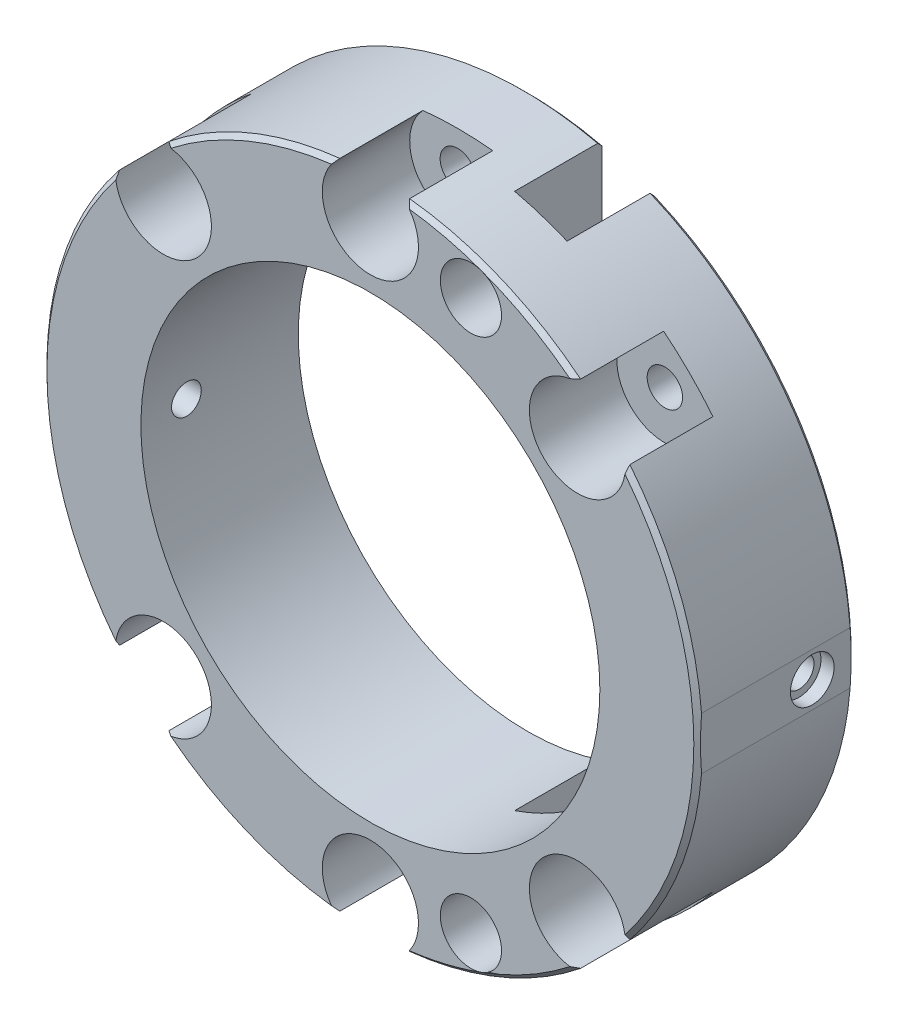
ISO-10303-21;
HEADER;
FILE_DESCRIPTION(('STEP AP214'),'2;1');
FILE_NAME('part.step','',(''),(''),'','','');
FILE_SCHEMA(('AUTOMOTIVE_DESIGN { 1 0 10303 214 1 1 1 1 }'));
ENDSEC;
DATA;
#1=APPLICATION_CONTEXT('core data for automotive mechanical design processes');
#2=APPLICATION_PROTOCOL_DEFINITION('international standard','automotive_design',2000,#1);
#3=PRODUCT_CONTEXT('',#1,'mechanical');
#4=PRODUCT('Part','Part','',(#3));
#5=PRODUCT_RELATED_PRODUCT_CATEGORY('part','',(#4));
#6=PRODUCT_DEFINITION_FORMATION('','',#4);
#7=PRODUCT_DEFINITION_CONTEXT('part definition',#1,'design');
#8=PRODUCT_DEFINITION('design','',#6,#7);
#9=PRODUCT_DEFINITION_SHAPE('','',#8);
#10=(LENGTH_UNIT() NAMED_UNIT(*) SI_UNIT(.MILLI.,.METRE.));
#11=(NAMED_UNIT(*) PLANE_ANGLE_UNIT() SI_UNIT($,.RADIAN.));
#12=(NAMED_UNIT(*) SI_UNIT($,.STERADIAN.) SOLID_ANGLE_UNIT());
#13=UNCERTAINTY_MEASURE_WITH_UNIT(LENGTH_MEASURE(1.E-05),#10,'distance_accuracy_value','');
#14=(GEOMETRIC_REPRESENTATION_CONTEXT(3) GLOBAL_UNCERTAINTY_ASSIGNED_CONTEXT((#13)) GLOBAL_UNIT_ASSIGNED_CONTEXT((#10,
#11,#12)) REPRESENTATION_CONTEXT('',''));
#15=CARTESIAN_POINT('',(0.,0.,0.));
#16=DIRECTION('',(0.,0.,1.));
#17=DIRECTION('',(1.,0.,0.));
#18=AXIS2_PLACEMENT_3D('',#15,#16,#17);
#19=CARTESIAN_POINT('',(0.,0.,0.));
#20=DIRECTION('',(0.,0.,1.));
#21=DIRECTION('',(1.,0.,0.));
#22=AXIS2_PLACEMENT_3D('',#19,#20,#21);
#23=PLANE('',#22);
#24=CARTESIAN_POINT('',(0.,-67.,0.));
#25=DIRECTION('',(0.,0.,-1.));
#26=DIRECTION('',(-1.,0.,0.));
#27=AXIS2_PLACEMENT_3D('',#24,#25,#26);
#28=CIRCLE('',#27,4.05);
#29=CARTESIAN_POINT('',(-4.05,-67.,0.));
#30=VERTEX_POINT('',#29);
#31=EDGE_CURVE('E306',#30,#30,#28,.T.);
#32=ORIENTED_EDGE('',*,*,#31,.F.);
#33=EDGE_LOOP('',(#32));
#34=FACE_BOUND('',#33,.T.);
#35=CARTESIAN_POINT('',(0.,67.,0.));
#36=DIRECTION('',(0.,0.,1.));
#37=DIRECTION('',(1.,0.,0.));
#38=AXIS2_PLACEMENT_3D('',#35,#36,#37);
#39=CIRCLE('',#38,4.05);
#40=CARTESIAN_POINT('',(4.05,67.,0.));
#41=VERTEX_POINT('',#40);
#42=EDGE_CURVE('E315',#41,#41,#39,.T.);
#43=ORIENTED_EDGE('',*,*,#42,.T.);
#44=EDGE_LOOP('',(#43));
#45=FACE_BOUND('',#44,.T.);
#46=CARTESIAN_POINT('',(-47.3761543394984,47.376154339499,0.));
#47=DIRECTION('',(0.,0.,-1.));
#48=DIRECTION('',(-1.,0.,0.));
#49=AXIS2_PLACEMENT_3D('',#46,#47,#48);
#50=CIRCLE('',#49,4.05);
#51=CARTESIAN_POINT('',(-51.4261543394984,47.376154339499,0.));
#52=VERTEX_POINT('',#51);
#53=EDGE_CURVE('E312',#52,#52,#50,.T.);
#54=ORIENTED_EDGE('',*,*,#53,.F.);
#55=EDGE_LOOP('',(#54));
#56=FACE_BOUND('',#55,.T.);
#57=CARTESIAN_POINT('',(-47.3761543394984,-47.376154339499,0.));
#58=DIRECTION('',(0.,0.,1.));
#59=DIRECTION('',(1.,0.,0.));
#60=AXIS2_PLACEMENT_3D('',#57,#58,#59);
#61=CIRCLE('',#60,4.05);
#62=CARTESIAN_POINT('',(-43.3261543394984,-47.376154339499,0.));
#63=VERTEX_POINT('',#62);
#64=EDGE_CURVE('E309',#63,#63,#61,.T.);
#65=ORIENTED_EDGE('',*,*,#64,.T.);
#66=EDGE_LOOP('',(#65));
#67=FACE_BOUND('',#66,.T.);
#68=DIRECTION('',(0.,-1.,0.));
#69=VECTOR('',#68,1.);
#70=CARTESIAN_POINT('',(-64.7596147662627,50.,0.));
#71=LINE('',#70,#69);
#72=CARTESIAN_POINT('',(-64.7596147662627,35.8077127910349,0.));
#73=VERTEX_POINT('',#72);
#74=CARTESIAN_POINT('',(-64.7596147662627,-35.8077127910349,0.));
#75=VERTEX_POINT('',#74);
#76=EDGE_CURVE('E289',#73,#75,#71,.T.);
#77=ORIENTED_EDGE('',*,*,#76,.F.);
#78=CARTESIAN_POINT('',(0.,0.,0.));
#79=DIRECTION('',(0.,0.,1.));
#80=DIRECTION('',(1.,0.,0.));
#81=AXIS2_PLACEMENT_3D('',#78,#79,#80);
#82=CIRCLE('',#81,74.);
#83=CARTESIAN_POINT('',(17.,72.0208303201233,0.));
#84=VERTEX_POINT('',#83);
#85=EDGE_CURVE('E56',#73,#84,#82,.F.);
#86=ORIENTED_EDGE('',*,*,#85,.T.);
#87=DIRECTION('',(0.,1.,0.));
#88=VECTOR('',#87,1.);
#89=CARTESIAN_POINT('',(17.,-80.,0.));
#90=LINE('',#89,#88);
#91=CARTESIAN_POINT('',(17.,49.6714203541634,0.));
#92=VERTEX_POINT('',#91);
#93=EDGE_CURVE('E1054',#92,#84,#90,.T.);
#94=ORIENTED_EDGE('',*,*,#93,.F.);
#95=CARTESIAN_POINT('',(0.,0.,0.));
#96=DIRECTION('',(0.,0.,1.));
#97=DIRECTION('',(1.,0.,0.));
#98=AXIS2_PLACEMENT_3D('',#95,#96,#97);
#99=CIRCLE('',#98,52.5);
#100=CARTESIAN_POINT('',(17.,-49.6714203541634,0.));
#101=VERTEX_POINT('',#100);
#102=EDGE_CURVE('E324',#92,#101,#99,.T.);
#103=ORIENTED_EDGE('',*,*,#102,.T.);
#104=CARTESIAN_POINT('',(17.,-72.0208303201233,0.));
#105=VERTEX_POINT('',#104);
#106=EDGE_CURVE('E1056',#105,#101,#90,.T.);
#107=ORIENTED_EDGE('',*,*,#106,.F.);
#108=EDGE_CURVE('E626',#105,#75,#82,.F.);
#109=ORIENTED_EDGE('',*,*,#108,.T.);
#110=EDGE_LOOP('',(#77,#86,#94,#103,#107,#109));
#111=FACE_BOUND('',#110,.T.);
#112=ADVANCED_FACE('F28',(#34,#45,#56,#67,#111),#23,.F.);
#113=CARTESIAN_POINT('',(0.,0.,1.00000000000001));
#114=DIRECTION('',(0.,0.,1.));
#115=DIRECTION('',(1.,0.,0.));
#116=AXIS2_PLACEMENT_3D('',#113,#114,#115);
#117=CONICAL_SURFACE('',#116,75.,0.785398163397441);
#118=CARTESIAN_POINT('',(0.,0.,1.00000000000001));
#119=DIRECTION('',(0.,0.,1.));
#120=DIRECTION('',(1.,0.,0.));
#121=AXIS2_PLACEMENT_3D('',#118,#119,#120);
#122=CIRCLE('',#121,75.);
#123=CARTESIAN_POINT('',(-64.7596147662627,-37.8311022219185,1.00000000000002));
#124=VERTEX_POINT('',#123);
#125=CARTESIAN_POINT('',(17.,-73.0479294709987,1.00000000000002));
#126=VERTEX_POINT('',#125);
#127=EDGE_CURVE('E574',#124,#126,#122,.T.);
#128=ORIENTED_EDGE('',*,*,#127,.F.);
#129=CARTESIAN_POINT('',(-64.7596147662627,-103.62200136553,48.1938086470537));
#130=CARTESIAN_POINT('',(-64.7596147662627,-102.307530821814,47.0791496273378));
#131=CARTESIAN_POINT('',(-64.7596147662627,-100.990145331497,45.96791823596));
#132=CARTESIAN_POINT('',(-64.7596147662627,-98.348919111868,43.753122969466));
#133=CARTESIAN_POINT('',(-64.7596147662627,-97.0250783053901,42.6495591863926));
#134=CARTESIAN_POINT('',(-64.7596147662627,-94.3700551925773,40.4506959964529));
#135=CARTESIAN_POINT('',(-64.7596147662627,-93.0388713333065,39.3553984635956));
#136=CARTESIAN_POINT('',(-64.7596147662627,-90.3687484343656,37.1743007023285));
#137=CARTESIAN_POINT('',(-64.7596147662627,-89.029809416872,36.0885004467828));
#138=CARTESIAN_POINT('',(-64.7596147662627,-86.3342985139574,33.9202175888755));
#139=CARTESIAN_POINT('',(-64.7596147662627,-84.9776686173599,32.8378070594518));
#140=CARTESIAN_POINT('',(-64.7596147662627,-82.2548327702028,30.6851003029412));
#141=CARTESIAN_POINT('',(-64.7596147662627,-80.8886268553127,29.6148040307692));
#142=CARTESIAN_POINT('',(-64.7596147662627,-78.1457078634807,27.4879761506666));
#143=CARTESIAN_POINT('',(-64.7596147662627,-76.7689956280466,26.431443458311));
#144=CARTESIAN_POINT('',(-64.7596147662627,-74.0037866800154,24.3339023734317));
#145=CARTESIAN_POINT('',(-64.7596147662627,-72.6152899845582,23.2928939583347));
#146=CARTESIAN_POINT('',(-64.7596147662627,-69.8812673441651,21.270078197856));
#147=CARTESIAN_POINT('',(-64.7596147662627,-68.5362579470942,20.2875733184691));
#148=CARTESIAN_POINT('',(-64.7596147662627,-65.8328310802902,18.3411567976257));
#149=CARTESIAN_POINT('',(-64.7596147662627,-64.4744135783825,17.3772452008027));
#150=CARTESIAN_POINT('',(-64.7596147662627,-61.7424091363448,15.4705282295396));
#151=CARTESIAN_POINT('',(-64.7596147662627,-60.3688191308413,14.5277272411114));
#152=CARTESIAN_POINT('',(-64.7596147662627,-57.6050976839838,12.6666672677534));
#153=CARTESIAN_POINT('',(-64.7596147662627,-56.2149663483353,11.748408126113));
#154=CARTESIAN_POINT('',(-64.7596147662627,-53.4192494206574,9.94216934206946));
#155=CARTESIAN_POINT('',(-64.7596147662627,-52.0137021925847,9.05413043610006));
#156=CARTESIAN_POINT('',(-64.7596147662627,-49.1822842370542,7.3108855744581));
#157=CARTESIAN_POINT('',(-64.7596147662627,-47.7564128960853,6.45568061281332));
#158=CARTESIAN_POINT('',(-64.7596147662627,-44.8828496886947,4.78396203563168));
#159=CARTESIAN_POINT('',(-64.7596147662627,-43.4351665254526,3.96743349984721));
#160=CARTESIAN_POINT('',(-64.7596147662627,-40.515422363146,2.3793584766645));
#161=CARTESIAN_POINT('',(-64.7596147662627,-39.0433638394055,1.60780745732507));
#162=CARTESIAN_POINT('',(-64.7596147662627,-36.2829463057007,0.222932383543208));
#163=CARTESIAN_POINT('',(-64.7596147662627,-34.9980749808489,-0.39733072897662));
#164=CARTESIAN_POINT('',(-64.7596147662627,-32.4076715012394,-1.59319876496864));
#165=CARTESIAN_POINT('',(-64.7596147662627,-31.1021398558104,-2.16880478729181));
#166=CARTESIAN_POINT('',(-64.7596147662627,-28.471532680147,-3.26803982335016));
#167=CARTESIAN_POINT('',(-64.7596147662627,-27.1464885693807,-3.7917437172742));
#168=CARTESIAN_POINT('',(-64.7596147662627,-24.474658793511,-4.78095022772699));
#169=CARTESIAN_POINT('',(-64.7596147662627,-23.1278719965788,-5.24644980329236));
#170=CARTESIAN_POINT('',(-64.7596147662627,-20.3914750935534,-6.11840108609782));
#171=CARTESIAN_POINT('',(-64.7596147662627,-19.0015245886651,-6.52378980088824));
#172=CARTESIAN_POINT('',(-64.7596147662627,-16.2016235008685,-7.2581322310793));
#173=CARTESIAN_POINT('',(-64.7596147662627,-14.7916768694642,-7.5871008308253));
#174=CARTESIAN_POINT('',(-64.7596147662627,-12.660024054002,-8.01821976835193));
#175=CARTESIAN_POINT('',(-64.7596147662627,-11.944579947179,-8.15183382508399));
#176=CARTESIAN_POINT('',(-64.7596147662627,-10.5098930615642,-8.39690457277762));
#177=CARTESIAN_POINT('',(-64.7596147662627,-9.79065035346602,-8.50836167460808));
#178=CARTESIAN_POINT('',(-64.7596147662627,-8.34842408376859,-8.70839459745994));
#179=CARTESIAN_POINT('',(-64.7596147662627,-7.62543807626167,-8.79695280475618));
#180=CARTESIAN_POINT('',(-64.7596147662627,-6.17690875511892,-8.950463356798));
#181=CARTESIAN_POINT('',(-64.7596147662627,-5.45136524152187,-9.01541381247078));
#182=CARTESIAN_POINT('',(-64.7596147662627,-4.72491870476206,-9.06824689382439));
#183=B_SPLINE_CURVE_WITH_KNOTS('',3,(#129,#130,#131,#132,#133,#134,#135,#136,#137,#138,#139,
#140,#141,#142,#143,#144,#145,#146,#147,#148,#149,#150,#151,#152,#153,#154,#155,#156,#157,#158,
#159,#160,#161,#162,#163,#164,#165,#166,#167,#168,#169,#170,#171,#172,#173,#174,#175,#176,#177,
#178,#179,#180,#181,#182),.UNSPECIFIED.,.F.,.F.,(4,2,2,2,2,2,2,2,2,2,2,2,2,2,2,2,2,2,2,2,2,2,2,
2,2,2,4),(0.,5.17036891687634,10.3407997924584,15.5123696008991,20.683924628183,
25.8904471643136,31.0969503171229,36.303040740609,41.509123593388,46.5059138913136,
51.5027161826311,56.5005471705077,61.4983462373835,66.4857017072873,71.4732080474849,
76.4587744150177,81.4438375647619,85.7233592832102,90.0027756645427,94.2759253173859,
98.5492981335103,102.890990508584,107.231836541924,109.414989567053,111.598102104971,
113.782888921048,115.967850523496),.UNSPECIFIED.);
#184=EDGE_CURVE('E11',#124,#75,#183,.T.);
#185=ORIENTED_EDGE('',*,*,#184,.T.);
#186=ORIENTED_EDGE('',*,*,#108,.F.);
#187=CARTESIAN_POINT('',(17.,-73.0479294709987,1.00000000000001));
#188=CARTESIAN_POINT('',(17.,-72.8767769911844,0.833301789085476));
#189=CARTESIAN_POINT('',(17.,-72.7056091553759,0.666619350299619));
#190=CARTESIAN_POINT('',(17.,-72.3632427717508,0.333286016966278));
#191=CARTESIAN_POINT('',(17.,-72.1920442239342,0.166635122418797));
#192=CARTESIAN_POINT('',(17.,-72.0208303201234,0.));
#193=B_SPLINE_CURVE_WITH_KNOTS('',3,(#187,#188,#189,#190,#191,#192),.UNSPECIFIED.,.F.,.F.,(4,2,
4),(0.,0.716751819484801,1.43350363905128),.UNSPECIFIED.);
#194=EDGE_CURVE('E621',#126,#105,#193,.T.);
#195=ORIENTED_EDGE('',*,*,#194,.F.);
#196=EDGE_LOOP('',(#128,#185,#186,#195));
#197=FACE_BOUND('',#196,.T.);
#198=ADVANCED_FACE('F541',(#197),#117,.T.);
#199=ORIENTED_EDGE('',*,*,#85,.F.);
#200=CARTESIAN_POINT('',(-64.7596147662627,4.72491870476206,-9.06824689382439));
#201=CARTESIAN_POINT('',(-64.7596147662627,5.25509625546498,-9.02967286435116));
#202=CARTESIAN_POINT('',(-64.7596147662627,5.78478218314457,-8.98466333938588));
#203=CARTESIAN_POINT('',(-64.7596147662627,6.84291119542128,-8.88198406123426));
#204=CARTESIAN_POINT('',(-64.7596147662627,7.37135431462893,-8.82431466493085));
#205=CARTESIAN_POINT('',(-64.7596147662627,8.95412192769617,-8.63267171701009));
#206=CARTESIAN_POINT('',(-64.7596147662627,10.0062396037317,-8.48003732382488));
#207=CARTESIAN_POINT('',(-64.7596147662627,12.1003078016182,-8.12768644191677));
#208=CARTESIAN_POINT('',(-64.7596147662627,13.142274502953,-7.92806515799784));
#209=CARTESIAN_POINT('',(-64.7596147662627,15.216736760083,-7.48436250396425));
#210=CARTESIAN_POINT('',(-64.7596147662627,16.2492317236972,-7.24027837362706));
#211=CARTESIAN_POINT('',(-64.7596147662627,18.2916654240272,-6.71381804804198));
#212=CARTESIAN_POINT('',(-64.7596147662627,19.3017269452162,-6.43191677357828));
#213=CARTESIAN_POINT('',(-64.7596147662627,21.3106178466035,-5.83086147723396));
#214=CARTESIAN_POINT('',(-64.7596147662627,22.3094472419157,-5.51170750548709));
#215=CARTESIAN_POINT('',(-64.7596147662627,25.2890561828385,-4.50287986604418));
#216=CARTESIAN_POINT('',(-64.7596147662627,27.2526962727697,-3.76190908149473));
#217=CARTESIAN_POINT('',(-64.7596147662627,29.9008602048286,-2.67362156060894));
#218=CARTESIAN_POINT('',(-64.7596147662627,30.6060331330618,-2.37502274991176));
#219=CARTESIAN_POINT('',(-64.7596147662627,32.0101726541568,-1.76386351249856));
#220=CARTESIAN_POINT('',(-64.7596147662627,32.7091404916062,-1.45130596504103));
#221=CARTESIAN_POINT('',(-64.7596147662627,34.1031924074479,-0.812224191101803));
#222=CARTESIAN_POINT('',(-64.7596147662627,34.7982584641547,-0.485660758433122));
#223=CARTESIAN_POINT('',(-64.7596147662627,35.836452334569,0.0132888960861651));
#224=CARTESIAN_POINT('',(-64.7596147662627,36.1817758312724,0.181119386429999));
#225=CARTESIAN_POINT('',(-64.7596147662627,36.8709824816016,0.519708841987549));
#226=CARTESIAN_POINT('',(-64.7596147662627,37.214865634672,0.690467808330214));
#227=CARTESIAN_POINT('',(-64.7596147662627,39.0949023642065,1.63366200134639));
#228=CARTESIAN_POINT('',(-64.7596147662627,40.6176590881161,2.43297985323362));
#229=CARTESIAN_POINT('',(-64.7596147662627,43.6371583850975,4.07949565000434));
#230=CARTESIAN_POINT('',(-64.7596147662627,45.1338972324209,4.92670037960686));
#231=CARTESIAN_POINT('',(-64.7596147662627,48.1043685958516,6.66216211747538));
#232=CARTESIAN_POINT('',(-64.7596147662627,49.5780888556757,7.55044006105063));
#233=CARTESIAN_POINT('',(-64.7596147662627,52.5039705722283,9.36159005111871));
#234=CARTESIAN_POINT('',(-64.7596147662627,53.9561329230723,10.2844606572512));
#235=CARTESIAN_POINT('',(-64.7596147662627,56.8455067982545,12.1626988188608));
#236=CARTESIAN_POINT('',(-64.7596147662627,58.2826597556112,13.1181562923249));
#237=CARTESIAN_POINT('',(-64.7596147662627,61.1395454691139,15.0547528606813));
#238=CARTESIAN_POINT('',(-64.7596147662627,62.5592780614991,16.0358921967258));
#239=CARTESIAN_POINT('',(-64.7596147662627,65.3827600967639,18.0201320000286));
#240=CARTESIAN_POINT('',(-64.7596147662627,66.786513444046,19.0232269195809));
#241=CARTESIAN_POINT('',(-64.7596147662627,69.5799995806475,21.0487186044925));
#242=CARTESIAN_POINT('',(-64.7596147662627,70.969732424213,22.0711152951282));
#243=CARTESIAN_POINT('',(-64.7596147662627,73.6977878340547,24.1038613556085));
#244=CARTESIAN_POINT('',(-64.7596147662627,75.0364587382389,25.1137437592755));
#245=CARTESIAN_POINT('',(-64.7596147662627,77.7030672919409,27.1475696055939));
#246=CARTESIAN_POINT('',(-64.7596147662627,79.031004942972,28.1715130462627));
#247=CARTESIAN_POINT('',(-64.7596147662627,81.6772777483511,30.2319339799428));
#248=CARTESIAN_POINT('',(-64.7596147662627,82.9956121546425,31.2684124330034));
#249=CARTESIAN_POINT('',(-64.7596147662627,85.6234914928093,33.3524542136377));
#250=CARTESIAN_POINT('',(-64.7596147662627,86.9330363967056,34.4000175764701));
#251=CARTESIAN_POINT('',(-64.7596147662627,89.5346386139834,36.4973810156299));
#252=CARTESIAN_POINT('',(-64.7596147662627,90.826753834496,37.5471093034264));
#253=CARTESIAN_POINT('',(-64.7596147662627,93.4038218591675,39.6553237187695));
#254=CARTESIAN_POINT('',(-64.7596147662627,94.6887746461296,40.7138098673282));
#255=CARTESIAN_POINT('',(-64.7596147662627,97.2518920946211,42.8384528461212));
#256=CARTESIAN_POINT('',(-64.7596147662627,98.5300580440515,43.9046081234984));
#257=CARTESIAN_POINT('',(-64.7596147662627,101.080389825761,46.0440454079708));
#258=CARTESIAN_POINT('',(-64.7596147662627,102.352555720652,47.1173273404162));
#259=CARTESIAN_POINT('',(-64.7596147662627,103.62200136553,48.1938086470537));
#260=B_SPLINE_CURVE_WITH_KNOTS('',3,(#200,#201,#202,#203,#204,#205,#206,#207,#208,#209,#210,
#211,#212,#213,#214,#215,#216,#217,#218,#219,#220,#221,#222,#223,#224,#225,#226,#227,#228,#229,
#230,#231,#232,#233,#234,#235,#236,#237,#238,#239,#240,#241,#242,#243,#244,#245,#246,#247,#248,
#249,#250,#251,#252,#253,#254,#255,#256,#257,#258,#259),.UNSPECIFIED.,.F.,.F.,(4,2,2,2,2,2,2,2,
2,2,2,2,2,2,2,2,2,2,2,2,2,2,2,2,2,2,2,2,2,4),(0.,1.59465366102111,3.18926237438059,
6.37741324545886,9.55915906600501,12.7411024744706,15.8862882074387,19.0314697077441,
25.3226382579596,27.6199459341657,29.9167819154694,32.2205310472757,33.3723591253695,
34.5241876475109,39.6823986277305,44.8413422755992,50.0029451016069,55.1643332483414,
60.3413460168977,65.5184074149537,70.6941754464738,75.8699234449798,80.900438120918,
85.9309520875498,90.9618538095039,95.9927715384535,100.987068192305,105.981376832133,
110.974701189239,115.967973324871),.UNSPECIFIED.);
#261=CARTESIAN_POINT('',(-64.7596147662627,37.8311022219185,1.00000000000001));
#262=VERTEX_POINT('',#261);
#263=EDGE_CURVE('E41',#73,#262,#260,.T.);
#264=ORIENTED_EDGE('',*,*,#263,.T.);
#265=CARTESIAN_POINT('',(0.,0.,1.00000000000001));
#266=DIRECTION('',(0.,0.,1.));
#267=DIRECTION('',(1.,0.,0.));
#268=AXIS2_PLACEMENT_3D('',#265,#266,#267);
#269=CIRCLE('',#268,75.);
#270=CARTESIAN_POINT('',(17.,73.0479294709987,1.00000000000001));
#271=VERTEX_POINT('',#270);
#272=EDGE_CURVE('E1002',#271,#262,#269,.T.);
#273=ORIENTED_EDGE('',*,*,#272,.F.);
#274=CARTESIAN_POINT('',(17.,72.0208303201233,0.));
#275=CARTESIAN_POINT('',(17.,72.1920442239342,0.166635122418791));
#276=CARTESIAN_POINT('',(17.,72.3632427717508,0.33328601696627));
#277=CARTESIAN_POINT('',(17.,72.7056091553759,0.666619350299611));
#278=CARTESIAN_POINT('',(17.,72.8767769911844,0.83330178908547));
#279=CARTESIAN_POINT('',(17.,73.0479294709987,1.00000000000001));
#280=B_SPLINE_CURVE_WITH_KNOTS('',3,(#274,#275,#276,#277,#278,#279),.UNSPECIFIED.,.F.,.F.,(4,2,
4),(0.,0.716751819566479,1.43350363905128),.UNSPECIFIED.);
#281=EDGE_CURVE('E635',#84,#271,#280,.T.);
#282=ORIENTED_EDGE('',*,*,#281,.F.);
#283=EDGE_LOOP('',(#199,#264,#273,#282));
#284=FACE_BOUND('',#283,.T.);
#285=ADVANCED_FACE('F630',(#284),#117,.T.);
#286=CARTESIAN_POINT('',(23.,-62.9285308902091,0.));
#287=DIRECTION('',(0.,0.,1.));
#288=DIRECTION('',(1.,0.,0.));
#289=AXIS2_PLACEMENT_3D('',#286,#287,#288);
#290=CYLINDRICAL_SURFACE('',#289,4.05);
#291=CARTESIAN_POINT('',(23.,-62.9285308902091,20.));
#292=DIRECTION('',(0.,0.,1.));
#293=DIRECTION('',(1.,0.,0.));
#294=AXIS2_PLACEMENT_3D('',#291,#292,#293);
#295=CIRCLE('',#294,4.05);
#296=CARTESIAN_POINT('',(27.05,-62.9285308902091,20.));
#297=VERTEX_POINT('',#296);
#298=EDGE_CURVE('E390',#297,#297,#295,.T.);
#299=ORIENTED_EDGE('',*,*,#298,.F.);
#300=EDGE_LOOP('',(#299));
#301=FACE_BOUND('',#300,.T.);
#302=CARTESIAN_POINT('',(23.,-62.9285308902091,26.));
#303=DIRECTION('',(0.,0.,1.));
#304=DIRECTION('',(1.,0.,0.));
#305=AXIS2_PLACEMENT_3D('',#302,#303,#304);
#306=CIRCLE('',#305,4.05);
#307=CARTESIAN_POINT('',(27.05,-62.9285308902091,26.));
#308=VERTEX_POINT('',#307);
#309=EDGE_CURVE('E397',#308,#308,#306,.F.);
#310=ORIENTED_EDGE('',*,*,#309,.F.);
#311=EDGE_LOOP('',(#310));
#312=FACE_BOUND('',#311,.T.);
#313=ADVANCED_FACE('F1156',(#301,#312),#290,.F.);
#314=CARTESIAN_POINT('',(23.,62.9285308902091,0.));
#315=DIRECTION('',(0.,0.,1.));
#316=DIRECTION('',(1.,0.,0.));
#317=AXIS2_PLACEMENT_3D('',#314,#315,#316);
#318=CYLINDRICAL_SURFACE('',#317,4.05);
#319=CARTESIAN_POINT('',(23.,62.9285308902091,20.));
#320=DIRECTION('',(0.,0.,1.));
#321=DIRECTION('',(1.,0.,0.));
#322=AXIS2_PLACEMENT_3D('',#319,#320,#321);
#323=CIRCLE('',#322,4.05);
#324=CARTESIAN_POINT('',(27.05,62.9285308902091,20.));
#325=VERTEX_POINT('',#324);
#326=EDGE_CURVE('E386',#325,#325,#323,.T.);
#327=ORIENTED_EDGE('',*,*,#326,.F.);
#328=EDGE_LOOP('',(#327));
#329=FACE_BOUND('',#328,.T.);
#330=CARTESIAN_POINT('',(23.,62.9285308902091,26.));
#331=DIRECTION('',(0.,0.,1.));
#332=DIRECTION('',(1.,0.,0.));
#333=AXIS2_PLACEMENT_3D('',#330,#331,#332);
#334=CIRCLE('',#333,4.05);
#335=CARTESIAN_POINT('',(27.05,62.9285308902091,26.));
#336=VERTEX_POINT('',#335);
#337=EDGE_CURVE('E393',#336,#336,#334,.F.);
#338=ORIENTED_EDGE('',*,*,#337,.F.);
#339=EDGE_LOOP('',(#338));
#340=FACE_BOUND('',#339,.T.);
#341=ADVANCED_FACE('F1159',(#329,#340),#318,.F.);
#342=CARTESIAN_POINT('',(47.3761543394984,-47.376154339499,0.));
#343=DIRECTION('',(0.,0.,-1.));
#344=DIRECTION('',(-1.,0.,0.));
#345=AXIS2_PLACEMENT_3D('',#342,#343,#344);
#346=CIRCLE('',#345,4.05);
#347=CARTESIAN_POINT('',(43.3261543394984,-47.376154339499,0.));
#348=VERTEX_POINT('',#347);
#349=EDGE_CURVE('E297',#348,#348,#346,.T.);
#350=ORIENTED_EDGE('',*,*,#349,.F.);
#351=EDGE_LOOP('',(#350));
#352=FACE_BOUND('',#351,.T.);
#353=CARTESIAN_POINT('',(47.3761543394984,47.376154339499,0.));
#354=DIRECTION('',(0.,0.,1.));
#355=DIRECTION('',(1.,0.,0.));
#356=AXIS2_PLACEMENT_3D('',#353,#354,#355);
#357=CIRCLE('',#356,4.05);
#358=CARTESIAN_POINT('',(51.4261543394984,47.376154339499,0.));
#359=VERTEX_POINT('',#358);
#360=EDGE_CURVE('E318',#359,#359,#357,.T.);
#361=ORIENTED_EDGE('',*,*,#360,.T.);
#362=EDGE_LOOP('',(#361));
#363=FACE_BOUND('',#362,.T.);
#364=DIRECTION('',(0.,-1.,0.));
#365=VECTOR('',#364,1.);
#366=CARTESIAN_POINT('',(29.,80.,0.));
#367=LINE('',#366,#365);
#368=CARTESIAN_POINT('',(29.,68.0808343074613,0.));
#369=VERTEX_POINT('',#368);
#370=CARTESIAN_POINT('',(29.,43.7635693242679,0.));
#371=VERTEX_POINT('',#370);
#372=EDGE_CURVE('E1053',#369,#371,#367,.T.);
#373=ORIENTED_EDGE('',*,*,#372,.F.);
#374=CARTESIAN_POINT('',(0.,0.,0.));
#375=DIRECTION('',(0.,0.,1.));
#376=DIRECTION('',(1.,0.,0.));
#377=AXIS2_PLACEMENT_3D('',#374,#375,#376);
#378=CIRCLE('',#377,74.);
#379=CARTESIAN_POINT('',(29.,-68.0808343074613,0.));
#380=VERTEX_POINT('',#379);
#381=EDGE_CURVE('E592',#369,#380,#378,.F.);
#382=ORIENTED_EDGE('',*,*,#381,.T.);
#383=CARTESIAN_POINT('',(29.,-43.7635693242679,0.));
#384=VERTEX_POINT('',#383);
#385=EDGE_CURVE('E389',#384,#380,#367,.T.);
#386=ORIENTED_EDGE('',*,*,#385,.F.);
#387=EDGE_CURVE('E321',#384,#371,#99,.T.);
#388=ORIENTED_EDGE('',*,*,#387,.T.);
#389=EDGE_LOOP('',(#373,#382,#386,#388));
#390=FACE_BOUND('',#389,.T.);
#391=ADVANCED_FACE('F515',(#352,#363,#390),#23,.F.);
#392=CARTESIAN_POINT('',(47.3761543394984,-47.376154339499,36.));
#393=DIRECTION('',(0.,0.,-1.));
#394=DIRECTION('',(-1.,0.,0.));
#395=AXIS2_PLACEMENT_3D('',#392,#393,#394);
#396=CYLINDRICAL_SURFACE('',#395,4.05);
#397=ORIENTED_EDGE('',*,*,#349,.T.);
#398=EDGE_LOOP('',(#397));
#399=FACE_BOUND('',#398,.T.);
#400=CARTESIAN_POINT('',(47.3761543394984,-47.376154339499,16.));
#401=DIRECTION('',(0.,0.,1.));
#402=DIRECTION('',(1.,0.,0.));
#403=AXIS2_PLACEMENT_3D('',#400,#401,#402);
#404=CIRCLE('',#403,4.05);
#405=CARTESIAN_POINT('',(51.4261543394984,-47.376154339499,16.));
#406=VERTEX_POINT('',#405);
#407=EDGE_CURVE('E363',#406,#406,#404,.F.);
#408=ORIENTED_EDGE('',*,*,#407,.F.);
#409=EDGE_LOOP('',(#408));
#410=FACE_BOUND('',#409,.T.);
#411=ADVANCED_FACE('F511',(#399,#410),#396,.F.);
#412=CARTESIAN_POINT('',(0.,-67.,36.));
#413=DIRECTION('',(0.,0.,-1.));
#414=DIRECTION('',(-1.,0.,0.));
#415=AXIS2_PLACEMENT_3D('',#412,#413,#414);
#416=CYLINDRICAL_SURFACE('',#415,4.05);
#417=ORIENTED_EDGE('',*,*,#31,.T.);
#418=EDGE_LOOP('',(#417));
#419=FACE_BOUND('',#418,.T.);
#420=CARTESIAN_POINT('',(0.,-67.,16.));
#421=DIRECTION('',(0.,0.,1.));
#422=DIRECTION('',(1.,0.,0.));
#423=AXIS2_PLACEMENT_3D('',#420,#421,#422);
#424=CIRCLE('',#423,4.05);
#425=CARTESIAN_POINT('',(4.05,-67.,16.));
#426=VERTEX_POINT('',#425);
#427=EDGE_CURVE('E353',#426,#426,#424,.F.);
#428=ORIENTED_EDGE('',*,*,#427,.F.);
#429=EDGE_LOOP('',(#428));
#430=FACE_BOUND('',#429,.T.);
#431=ADVANCED_FACE('F514',(#419,#430),#416,.F.);
#432=CARTESIAN_POINT('',(-47.3761543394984,-47.376154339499,36.));
#433=DIRECTION('',(0.,0.,-1.));
#434=DIRECTION('',(-1.,0.,0.));
#435=AXIS2_PLACEMENT_3D('',#432,#433,#434);
#436=CYLINDRICAL_SURFACE('',#435,4.05);
#437=ORIENTED_EDGE('',*,*,#64,.F.);
#438=EDGE_LOOP('',(#437));
#439=FACE_BOUND('',#438,.T.);
#440=CARTESIAN_POINT('',(-47.3761543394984,-47.376154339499,16.));
#441=DIRECTION('',(0.,0.,1.));
#442=DIRECTION('',(1.,0.,0.));
#443=AXIS2_PLACEMENT_3D('',#440,#441,#442);
#444=CIRCLE('',#443,4.05);
#445=CARTESIAN_POINT('',(-43.3261543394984,-47.376154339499,16.));
#446=VERTEX_POINT('',#445);
#447=EDGE_CURVE('E344',#446,#446,#444,.T.);
#448=ORIENTED_EDGE('',*,*,#447,.T.);
#449=EDGE_LOOP('',(#448));
#450=FACE_BOUND('',#449,.T.);
#451=ADVANCED_FACE('F519',(#439,#450),#436,.F.);
#452=CARTESIAN_POINT('',(-47.3761543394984,47.376154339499,36.));
#453=DIRECTION('',(0.,0.,-1.));
#454=DIRECTION('',(-1.,0.,0.));
#455=AXIS2_PLACEMENT_3D('',#452,#453,#454);
#456=CYLINDRICAL_SURFACE('',#455,4.05);
#457=ORIENTED_EDGE('',*,*,#53,.T.);
#458=EDGE_LOOP('',(#457));
#459=FACE_BOUND('',#458,.T.);
#460=CARTESIAN_POINT('',(-47.3761543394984,47.376154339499,16.));
#461=DIRECTION('',(0.,0.,1.));
#462=DIRECTION('',(1.,0.,0.));
#463=AXIS2_PLACEMENT_3D('',#460,#461,#462);
#464=CIRCLE('',#463,4.05);
#465=CARTESIAN_POINT('',(-43.3261543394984,47.376154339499,16.));
#466=VERTEX_POINT('',#465);
#467=EDGE_CURVE('E339',#466,#466,#464,.F.);
#468=ORIENTED_EDGE('',*,*,#467,.F.);
#469=EDGE_LOOP('',(#468));
#470=FACE_BOUND('',#469,.T.);
#471=ADVANCED_FACE('F523',(#459,#470),#456,.F.);
#472=CARTESIAN_POINT('',(0.,67.,36.));
#473=DIRECTION('',(0.,0.,-1.));
#474=DIRECTION('',(-1.,0.,0.));
#475=AXIS2_PLACEMENT_3D('',#472,#473,#474);
#476=CYLINDRICAL_SURFACE('',#475,4.05);
#477=ORIENTED_EDGE('',*,*,#42,.F.);
#478=EDGE_LOOP('',(#477));
#479=FACE_BOUND('',#478,.T.);
#480=CARTESIAN_POINT('',(0.,67.,16.));
#481=DIRECTION('',(0.,0.,1.));
#482=DIRECTION('',(1.,0.,0.));
#483=AXIS2_PLACEMENT_3D('',#480,#481,#482);
#484=CIRCLE('',#483,4.05);
#485=CARTESIAN_POINT('',(4.05,67.,16.));
#486=VERTEX_POINT('',#485);
#487=EDGE_CURVE('E334',#486,#486,#484,.T.);
#488=ORIENTED_EDGE('',*,*,#487,.T.);
#489=EDGE_LOOP('',(#488));
#490=FACE_BOUND('',#489,.T.);
#491=ADVANCED_FACE('F527',(#479,#490),#476,.F.);
#492=CARTESIAN_POINT('',(47.3761543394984,47.376154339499,36.));
#493=DIRECTION('',(0.,0.,-1.));
#494=DIRECTION('',(-1.,0.,0.));
#495=AXIS2_PLACEMENT_3D('',#492,#493,#494);
#496=CYLINDRICAL_SURFACE('',#495,4.05);
#497=ORIENTED_EDGE('',*,*,#360,.F.);
#498=EDGE_LOOP('',(#497));
#499=FACE_BOUND('',#498,.T.);
#500=CARTESIAN_POINT('',(47.3761543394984,47.376154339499,16.));
#501=DIRECTION('',(0.,0.,1.));
#502=DIRECTION('',(1.,0.,0.));
#503=AXIS2_PLACEMENT_3D('',#500,#501,#502);
#504=CIRCLE('',#503,4.05);
#505=CARTESIAN_POINT('',(51.4261543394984,47.376154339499,16.));
#506=VERTEX_POINT('',#505);
#507=EDGE_CURVE('E329',#506,#506,#504,.T.);
#508=ORIENTED_EDGE('',*,*,#507,.T.);
#509=EDGE_LOOP('',(#508));
#510=FACE_BOUND('',#509,.T.);
#511=ADVANCED_FACE('F531',(#499,#510),#496,.F.);
#512=CARTESIAN_POINT('',(0.,0.,36.));
#513=DIRECTION('',(0.,0.,-1.));
#514=DIRECTION('',(-1.,0.,0.));
#515=AXIS2_PLACEMENT_3D('',#512,#513,#514);
#516=CYLINDRICAL_SURFACE('',#515,75.);
#517=DIRECTION('',(0.,0.,-1.));
#518=VECTOR('',#517,1.);
#519=CARTESIAN_POINT('',(-64.7596147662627,37.8311022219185,36.));
#520=LINE('',#519,#518);
#521=CARTESIAN_POINT('',(-64.7596147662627,37.8311022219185,17.));
#522=VERTEX_POINT('',#521);
#523=EDGE_CURVE('E48',#522,#262,#520,.T.);
#524=ORIENTED_EDGE('',*,*,#523,.F.);
#525=CARTESIAN_POINT('',(0.,0.,17.));
#526=DIRECTION('',(0.,0.,1.));
#527=DIRECTION('',(1.,0.,0.));
#528=AXIS2_PLACEMENT_3D('',#525,#526,#527);
#529=CIRCLE('',#528,75.);
#530=CARTESIAN_POINT('',(-74.7596147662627,6.00000000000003,17.));
#531=VERTEX_POINT('',#530);
#532=EDGE_CURVE('E278',#522,#531,#529,.T.);
#533=ORIENTED_EDGE('',*,*,#532,.T.);
#534=DIRECTION('',(0.,0.,1.));
#535=VECTOR('',#534,1.);
#536=CARTESIAN_POINT('',(-74.7596147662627,6.00000000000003,0.));
#537=LINE('',#536,#535);
#538=CARTESIAN_POINT('',(-74.7596147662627,6.00000000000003,35.));
#539=VERTEX_POINT('',#538);
#540=EDGE_CURVE('E288',#531,#539,#537,.T.);
#541=ORIENTED_EDGE('',*,*,#540,.T.);
#542=CARTESIAN_POINT('',(0.,0.,35.));
#543=DIRECTION('',(0.,0.,1.));
#544=DIRECTION('',(1.,0.,0.));
#545=AXIS2_PLACEMENT_3D('',#542,#543,#544);
#546=CIRCLE('',#545,75.);
#547=CARTESIAN_POINT('',(-58.3724826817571,47.0919660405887,35.));
#548=VERTEX_POINT('',#547);
#549=EDGE_CURVE('E1009',#539,#548,#546,.F.);
#550=ORIENTED_EDGE('',*,*,#549,.T.);
#551=DIRECTION('',(0.,0.,1.));
#552=VECTOR('',#551,1.);
#553=CARTESIAN_POINT('',(-58.3724826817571,47.0919660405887,26.));
#554=LINE('',#553,#552);
#555=CARTESIAN_POINT('',(-58.3724826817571,47.0919660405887,16.));
#556=VERTEX_POINT('',#555);
#557=EDGE_CURVE('E1019',#548,#556,#554,.F.);
#558=ORIENTED_EDGE('',*,*,#557,.T.);
#559=CARTESIAN_POINT('',(0.,0.,16.));
#560=DIRECTION('',(0.,0.,1.));
#561=DIRECTION('',(1.,0.,0.));
#562=AXIS2_PLACEMENT_3D('',#559,#560,#561);
#563=CIRCLE('',#562,75.);
#564=CARTESIAN_POINT('',(-47.0919660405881,58.3724826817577,16.));
#565=VERTEX_POINT('',#564);
#566=EDGE_CURVE('E342',#565,#556,#563,.T.);
#567=ORIENTED_EDGE('',*,*,#566,.F.);
#568=DIRECTION('',(0.,0.,1.));
#569=VECTOR('',#568,1.);
#570=CARTESIAN_POINT('',(-47.0919660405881,58.3724826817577,26.));
#571=LINE('',#570,#569);
#572=CARTESIAN_POINT('',(-47.0919660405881,58.3724826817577,35.));
#573=VERTEX_POINT('',#572);
#574=EDGE_CURVE('E1013',#565,#573,#571,.T.);
#575=ORIENTED_EDGE('',*,*,#574,.T.);
#576=CARTESIAN_POINT('',(0.,0.,35.));
#577=DIRECTION('',(0.,0.,1.));
#578=DIRECTION('',(1.,0.,0.));
#579=AXIS2_PLACEMENT_3D('',#576,#577,#578);
#580=CIRCLE('',#579,75.);
#581=CARTESIAN_POINT('',(-7.97652981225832,74.5746268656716,35.));
#582=VERTEX_POINT('',#581);
#583=EDGE_CURVE('E501',#573,#582,#580,.F.);
#584=ORIENTED_EDGE('',*,*,#583,.T.);
#585=DIRECTION('',(0.,0.,1.));
#586=VECTOR('',#585,1.);
#587=CARTESIAN_POINT('',(-7.97652981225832,74.5746268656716,26.));
#588=LINE('',#587,#586);
#589=CARTESIAN_POINT('',(-7.97652981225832,74.5746268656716,16.));
#590=VERTEX_POINT('',#589);
#591=EDGE_CURVE('E1029',#582,#590,#588,.F.);
#592=ORIENTED_EDGE('',*,*,#591,.T.);
#593=CARTESIAN_POINT('',(0.,0.,16.));
#594=DIRECTION('',(0.,0.,1.));
#595=DIRECTION('',(1.,0.,0.));
#596=AXIS2_PLACEMENT_3D('',#593,#594,#595);
#597=CIRCLE('',#596,75.);
#598=CARTESIAN_POINT('',(7.97652981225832,74.5746268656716,16.));
#599=VERTEX_POINT('',#598);
#600=EDGE_CURVE('E337',#599,#590,#597,.T.);
#601=ORIENTED_EDGE('',*,*,#600,.F.);
#602=DIRECTION('',(0.,0.,1.));
#603=VECTOR('',#602,1.);
#604=CARTESIAN_POINT('',(7.97652981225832,74.5746268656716,26.));
#605=LINE('',#604,#603);
#606=CARTESIAN_POINT('',(7.97652981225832,74.5746268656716,35.));
#607=VERTEX_POINT('',#606);
#608=EDGE_CURVE('E1031',#599,#607,#605,.T.);
#609=ORIENTED_EDGE('',*,*,#608,.T.);
#610=CARTESIAN_POINT('',(0.,0.,35.));
#611=DIRECTION('',(0.,0.,1.));
#612=DIRECTION('',(1.,0.,0.));
#613=AXIS2_PLACEMENT_3D('',#610,#611,#612);
#614=CIRCLE('',#613,75.);
#615=CARTESIAN_POINT('',(47.0919660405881,58.3724826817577,35.));
#616=VERTEX_POINT('',#615);
#617=EDGE_CURVE('E1003',#607,#616,#614,.F.);
#618=ORIENTED_EDGE('',*,*,#617,.T.);
#619=DIRECTION('',(0.,0.,1.));
#620=VECTOR('',#619,1.);
#621=CARTESIAN_POINT('',(47.0919660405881,58.3724826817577,26.));
#622=LINE('',#621,#620);
#623=CARTESIAN_POINT('',(47.0919660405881,58.3724826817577,16.));
#624=VERTEX_POINT('',#623);
#625=EDGE_CURVE('E1001',#616,#624,#622,.F.);
#626=ORIENTED_EDGE('',*,*,#625,.T.);
#627=CARTESIAN_POINT('',(0.,0.,16.));
#628=DIRECTION('',(0.,0.,1.));
#629=DIRECTION('',(1.,0.,0.));
#630=AXIS2_PLACEMENT_3D('',#627,#628,#629);
#631=CIRCLE('',#630,75.);
#632=CARTESIAN_POINT('',(58.3724826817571,47.0919660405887,16.));
#633=VERTEX_POINT('',#632);
#634=EDGE_CURVE('E332',#633,#624,#631,.T.);
#635=ORIENTED_EDGE('',*,*,#634,.F.);
#636=DIRECTION('',(0.,0.,1.));
#637=VECTOR('',#636,1.);
#638=CARTESIAN_POINT('',(58.3724826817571,47.0919660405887,26.));
#639=LINE('',#638,#637);
#640=CARTESIAN_POINT('',(58.3724826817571,47.0919660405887,35.));
#641=VERTEX_POINT('',#640);
#642=EDGE_CURVE('E714',#633,#641,#639,.T.);
#643=ORIENTED_EDGE('',*,*,#642,.T.);
#644=CARTESIAN_POINT('',(0.,0.,35.));
#645=DIRECTION('',(0.,0.,1.));
#646=DIRECTION('',(1.,0.,0.));
#647=AXIS2_PLACEMENT_3D('',#644,#645,#646);
#648=CIRCLE('',#647,75.);
#649=CARTESIAN_POINT('',(74.7596147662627,6.,35.));
#650=VERTEX_POINT('',#649);
#651=EDGE_CURVE('E999',#641,#650,#648,.F.);
#652=ORIENTED_EDGE('',*,*,#651,.T.);
#653=DIRECTION('',(0.,0.,1.));
#654=VECTOR('',#653,1.);
#655=CARTESIAN_POINT('',(74.7596147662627,6.,0.));
#656=LINE('',#655,#654);
#657=CARTESIAN_POINT('',(74.7596147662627,6.,1.00000000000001));
#658=VERTEX_POINT('',#657);
#659=EDGE_CURVE('E300',#658,#650,#656,.T.);
#660=ORIENTED_EDGE('',*,*,#659,.F.);
#661=CARTESIAN_POINT('',(0.,0.,1.00000000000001));
#662=DIRECTION('',(0.,0.,1.));
#663=DIRECTION('',(1.,0.,0.));
#664=AXIS2_PLACEMENT_3D('',#661,#662,#663);
#665=CIRCLE('',#664,75.);
#666=CARTESIAN_POINT('',(29.,69.1664658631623,1.00000000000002));
#667=VERTEX_POINT('',#666);
#668=EDGE_CURVE('E1006',#658,#667,#665,.T.);
#669=ORIENTED_EDGE('',*,*,#668,.T.);
#670=DIRECTION('',(0.,0.,-1.));
#671=VECTOR('',#670,1.);
#672=CARTESIAN_POINT('',(29.,69.1664658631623,36.));
#673=LINE('',#672,#671);
#674=CARTESIAN_POINT('',(29.,69.1664658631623,20.));
#675=VERTEX_POINT('',#674);
#676=EDGE_CURVE('E1076',#667,#675,#673,.F.);
#677=ORIENTED_EDGE('',*,*,#676,.T.);
#678=CARTESIAN_POINT('',(0.,0.,20.));
#679=DIRECTION('',(0.,0.,1.));
#680=DIRECTION('',(1.,0.,0.));
#681=AXIS2_PLACEMENT_3D('',#678,#679,#680);
#682=CIRCLE('',#681,75.);
#683=CARTESIAN_POINT('',(17.,73.0479294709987,20.));
#684=VERTEX_POINT('',#683);
#685=EDGE_CURVE('E1067',#675,#684,#682,.T.);
#686=ORIENTED_EDGE('',*,*,#685,.T.);
#687=DIRECTION('',(0.,0.,-1.));
#688=VECTOR('',#687,1.);
#689=CARTESIAN_POINT('',(17.,73.0479294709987,36.));
#690=LINE('',#689,#688);
#691=EDGE_CURVE('E1072',#684,#271,#690,.T.);
#692=ORIENTED_EDGE('',*,*,#691,.T.);
#693=ORIENTED_EDGE('',*,*,#272,.T.);
#694=EDGE_LOOP('',(#524,#533,#541,#550,#558,#567,#575,#584,#592,#601,#609,#618,#626,#635,#643,
#652,#660,#669,#677,#686,#692,#693));
#695=FACE_BOUND('',#694,.T.);
#696=ADVANCED_FACE('F535',(#695),#516,.T.);
#697=CARTESIAN_POINT('',(0.,0.,36.));
#698=DIRECTION('',(0.,0.,1.));
#699=DIRECTION('',(1.,0.,0.));
#700=AXIS2_PLACEMENT_3D('',#697,#698,#699);
#701=PLANE('',#700);
#702=CARTESIAN_POINT('',(-47.3761543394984,47.376154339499,36.));
#703=DIRECTION('',(0.,0.,1.));
#704=DIRECTION('',(1.,0.,0.));
#705=AXIS2_PLACEMENT_3D('',#702,#703,#704);
#706=CIRCLE('',#705,11.);
#707=CARTESIAN_POINT('',(-58.2401549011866,45.6517727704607,36.));
#708=VERTEX_POINT('',#707);
#709=CARTESIAN_POINT('',(-45.6517727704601,58.2401549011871,36.));
#710=VERTEX_POINT('',#709);
#711=EDGE_CURVE('E554',#708,#710,#706,.T.);
#712=ORIENTED_EDGE('',*,*,#711,.F.);
#713=CARTESIAN_POINT('',(0.,0.,36.));
#714=DIRECTION('',(0.,0.,1.));
#715=DIRECTION('',(1.,0.,0.));
#716=AXIS2_PLACEMENT_3D('',#713,#714,#715);
#717=CIRCLE('',#716,74.);
#718=CARTESIAN_POINT('',(-58.2401549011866,-45.6517727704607,36.));
#719=VERTEX_POINT('',#718);
#720=EDGE_CURVE('E420',#708,#719,#717,.T.);
#721=ORIENTED_EDGE('',*,*,#720,.T.);
#722=CARTESIAN_POINT('',(-47.3761543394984,-47.376154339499,36.));
#723=DIRECTION('',(0.,0.,1.));
#724=DIRECTION('',(1.,0.,0.));
#725=AXIS2_PLACEMENT_3D('',#722,#723,#724);
#726=CIRCLE('',#725,11.);
#727=CARTESIAN_POINT('',(-45.6517727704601,-58.2401549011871,36.));
#728=VERTEX_POINT('',#727);
#729=EDGE_CURVE('E1090',#728,#719,#726,.T.);
#730=ORIENTED_EDGE('',*,*,#729,.F.);
#731=CARTESIAN_POINT('',(0.,0.,36.));
#732=DIRECTION('',(0.,0.,1.));
#733=DIRECTION('',(1.,0.,0.));
#734=AXIS2_PLACEMENT_3D('',#731,#732,#733);
#735=CIRCLE('',#734,74.);
#736=CARTESIAN_POINT('',(-8.90133036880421,-73.4626865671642,36.));
#737=VERTEX_POINT('',#736);
#738=EDGE_CURVE('E417',#728,#737,#735,.T.);
#739=ORIENTED_EDGE('',*,*,#738,.T.);
#740=CARTESIAN_POINT('',(0.,-67.,36.));
#741=DIRECTION('',(0.,0.,1.));
#742=DIRECTION('',(1.,0.,0.));
#743=AXIS2_PLACEMENT_3D('',#740,#741,#742);
#744=CIRCLE('',#743,11.);
#745=CARTESIAN_POINT('',(8.90133036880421,-73.4626865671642,36.));
#746=VERTEX_POINT('',#745);
#747=EDGE_CURVE('E1084',#746,#737,#744,.T.);
#748=ORIENTED_EDGE('',*,*,#747,.F.);
#749=CARTESIAN_POINT('',(0.,0.,36.));
#750=DIRECTION('',(0.,0.,1.));
#751=DIRECTION('',(1.,0.,0.));
#752=AXIS2_PLACEMENT_3D('',#749,#750,#751);
#753=CIRCLE('',#752,74.);
#754=CARTESIAN_POINT('',(25.4029850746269,-69.5031535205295,36.));
#755=VERTEX_POINT('',#754);
#756=EDGE_CURVE('E414',#746,#755,#753,.T.);
#757=ORIENTED_EDGE('',*,*,#756,.T.);
#758=CARTESIAN_POINT('',(23.,-62.9285308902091,36.));
#759=DIRECTION('',(0.,0.,1.));
#760=DIRECTION('',(1.,0.,0.));
#761=AXIS2_PLACEMENT_3D('',#758,#759,#760);
#762=CIRCLE('',#761,7.);
#763=EDGE_CURVE('E1113',#755,#755,#762,.T.);
#764=ORIENTED_EDGE('',*,*,#763,.F.);
#765=CARTESIAN_POINT('',(0.,0.,36.));
#766=DIRECTION('',(0.,0.,1.));
#767=DIRECTION('',(1.,0.,0.));
#768=AXIS2_PLACEMENT_3D('',#765,#766,#767);
#769=CIRCLE('',#768,74.);
#770=CARTESIAN_POINT('',(45.6517727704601,-58.2401549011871,36.));
#771=VERTEX_POINT('',#770);
#772=EDGE_CURVE('E412',#755,#771,#769,.T.);
#773=ORIENTED_EDGE('',*,*,#772,.T.);
#774=CARTESIAN_POINT('',(47.3761543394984,-47.376154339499,36.));
#775=DIRECTION('',(0.,0.,1.));
#776=DIRECTION('',(1.,0.,0.));
#777=AXIS2_PLACEMENT_3D('',#774,#775,#776);
#778=CIRCLE('',#777,11.);
#779=CARTESIAN_POINT('',(58.2401549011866,-45.6517727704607,36.));
#780=VERTEX_POINT('',#779);
#781=EDGE_CURVE('E1078',#780,#771,#778,.T.);
#782=ORIENTED_EDGE('',*,*,#781,.F.);
#783=CARTESIAN_POINT('',(0.,0.,36.));
#784=DIRECTION('',(0.,0.,1.));
#785=DIRECTION('',(1.,0.,0.));
#786=AXIS2_PLACEMENT_3D('',#783,#784,#785);
#787=CIRCLE('',#786,74.);
#788=CARTESIAN_POINT('',(58.2401549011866,45.6517727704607,36.));
#789=VERTEX_POINT('',#788);
#790=EDGE_CURVE('E409',#780,#789,#787,.T.);
#791=ORIENTED_EDGE('',*,*,#790,.T.);
#792=CARTESIAN_POINT('',(47.3761543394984,47.376154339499,36.));
#793=DIRECTION('',(0.,0.,1.));
#794=DIRECTION('',(1.,0.,0.));
#795=AXIS2_PLACEMENT_3D('',#792,#793,#794);
#796=CIRCLE('',#795,11.);
#797=CARTESIAN_POINT('',(45.6517727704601,58.2401549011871,36.));
#798=VERTEX_POINT('',#797);
#799=EDGE_CURVE('E996',#798,#789,#796,.T.);
#800=ORIENTED_EDGE('',*,*,#799,.F.);
#801=CARTESIAN_POINT('',(0.,0.,36.));
#802=DIRECTION('',(0.,0.,1.));
#803=DIRECTION('',(1.,0.,0.));
#804=AXIS2_PLACEMENT_3D('',#801,#802,#803);
#805=CIRCLE('',#804,74.);
#806=CARTESIAN_POINT('',(25.4029850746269,69.5031535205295,36.));
#807=VERTEX_POINT('',#806);
#808=EDGE_CURVE('E406',#798,#807,#805,.T.);
#809=ORIENTED_EDGE('',*,*,#808,.T.);
#810=CARTESIAN_POINT('',(23.,62.9285308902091,36.));
#811=DIRECTION('',(0.,0.,1.));
#812=DIRECTION('',(1.,0.,0.));
#813=AXIS2_PLACEMENT_3D('',#810,#811,#812);
#814=CIRCLE('',#813,7.);
#815=EDGE_CURVE('E400',#807,#807,#814,.T.);
#816=ORIENTED_EDGE('',*,*,#815,.F.);
#817=CARTESIAN_POINT('',(0.,0.,36.));
#818=DIRECTION('',(0.,0.,1.));
#819=DIRECTION('',(1.,0.,0.));
#820=AXIS2_PLACEMENT_3D('',#817,#818,#819);
#821=CIRCLE('',#820,74.);
#822=CARTESIAN_POINT('',(8.90133036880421,73.4626865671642,36.));
#823=VERTEX_POINT('',#822);
#824=EDGE_CURVE('E404',#807,#823,#821,.T.);
#825=ORIENTED_EDGE('',*,*,#824,.T.);
#826=CARTESIAN_POINT('',(0.,67.,36.));
#827=DIRECTION('',(0.,0.,1.));
#828=DIRECTION('',(1.,0.,0.));
#829=AXIS2_PLACEMENT_3D('',#826,#827,#828);
#830=CIRCLE('',#829,11.);
#831=CARTESIAN_POINT('',(-8.90133036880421,73.4626865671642,36.));
#832=VERTEX_POINT('',#831);
#833=EDGE_CURVE('E1018',#832,#823,#830,.T.);
#834=ORIENTED_EDGE('',*,*,#833,.F.);
#835=CARTESIAN_POINT('',(0.,0.,36.));
#836=DIRECTION('',(0.,0.,1.));
#837=DIRECTION('',(1.,0.,0.));
#838=AXIS2_PLACEMENT_3D('',#835,#836,#837);
#839=CIRCLE('',#838,74.);
#840=EDGE_CURVE('E385',#832,#710,#839,.T.);
#841=ORIENTED_EDGE('',*,*,#840,.T.);
#842=EDGE_LOOP('',(#712,#721,#730,#739,#748,#757,#764,#773,#782,#791,#800,#809,#816,#825,#834,#841));
#843=FACE_BOUND('',#842,.T.);
#844=CARTESIAN_POINT('',(0.,0.,36.));
#845=DIRECTION('',(0.,0.,1.));
#846=DIRECTION('',(1.,0.,0.));
#847=AXIS2_PLACEMENT_3D('',#844,#845,#846);
#848=CIRCLE('',#847,52.5);
#849=CARTESIAN_POINT('',(52.5,0.,36.));
#850=VERTEX_POINT('',#849);
#851=EDGE_CURVE('E325',#850,#850,#848,.T.);
#852=ORIENTED_EDGE('',*,*,#851,.F.);
#853=EDGE_LOOP('',(#852));
#854=FACE_BOUND('',#853,.T.);
#855=ADVANCED_FACE('F543',(#843,#854),#701,.T.);
#856=DIRECTION('',(0.,0.,1.));
#857=VECTOR('',#856,1.);
#858=CARTESIAN_POINT('',(-74.7596147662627,-5.99999999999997,0.));
#859=LINE('',#858,#857);
#860=CARTESIAN_POINT('',(-74.7596147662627,-5.99999999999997,17.));
#861=VERTEX_POINT('',#860);
#862=CARTESIAN_POINT('',(-74.7596147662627,-5.99999999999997,35.));
#863=VERTEX_POINT('',#862);
#864=EDGE_CURVE('E286',#861,#863,#859,.T.);
#865=ORIENTED_EDGE('',*,*,#864,.F.);
#866=CARTESIAN_POINT('',(0.,0.,17.));
#867=DIRECTION('',(0.,0.,1.));
#868=DIRECTION('',(1.,0.,0.));
#869=AXIS2_PLACEMENT_3D('',#866,#867,#868);
#870=CIRCLE('',#869,75.);
#871=CARTESIAN_POINT('',(-64.7596147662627,-37.8311022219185,17.));
#872=VERTEX_POINT('',#871);
#873=EDGE_CURVE('E269',#861,#872,#870,.T.);
#874=ORIENTED_EDGE('',*,*,#873,.T.);
#875=DIRECTION('',(0.,0.,-1.));
#876=VECTOR('',#875,1.);
#877=CARTESIAN_POINT('',(-64.7596147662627,-37.8311022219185,36.));
#878=LINE('',#877,#876);
#879=EDGE_CURVE('E279',#124,#872,#878,.F.);
#880=ORIENTED_EDGE('',*,*,#879,.F.);
#881=ORIENTED_EDGE('',*,*,#127,.T.);
#882=DIRECTION('',(0.,0.,-1.));
#883=VECTOR('',#882,1.);
#884=CARTESIAN_POINT('',(17.,-73.0479294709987,36.));
#885=LINE('',#884,#883);
#886=CARTESIAN_POINT('',(17.,-73.0479294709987,20.));
#887=VERTEX_POINT('',#886);
#888=EDGE_CURVE('E1070',#126,#887,#885,.F.);
#889=ORIENTED_EDGE('',*,*,#888,.T.);
#890=CARTESIAN_POINT('',(0.,0.,20.));
#891=DIRECTION('',(0.,0.,1.));
#892=DIRECTION('',(1.,0.,0.));
#893=AXIS2_PLACEMENT_3D('',#890,#891,#892);
#894=CIRCLE('',#893,75.);
#895=CARTESIAN_POINT('',(29.,-69.1664658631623,20.));
#896=VERTEX_POINT('',#895);
#897=EDGE_CURVE('E1065',#887,#896,#894,.T.);
#898=ORIENTED_EDGE('',*,*,#897,.T.);
#899=DIRECTION('',(0.,0.,-1.));
#900=VECTOR('',#899,1.);
#901=CARTESIAN_POINT('',(29.,-69.1664658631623,36.));
#902=LINE('',#901,#900);
#903=CARTESIAN_POINT('',(29.,-69.1664658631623,1.00000000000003));
#904=VERTEX_POINT('',#903);
#905=EDGE_CURVE('E581',#896,#904,#902,.T.);
#906=ORIENTED_EDGE('',*,*,#905,.T.);
#907=CARTESIAN_POINT('',(0.,0.,1.00000000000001));
#908=DIRECTION('',(0.,0.,1.));
#909=DIRECTION('',(1.,0.,0.));
#910=AXIS2_PLACEMENT_3D('',#907,#908,#909);
#911=CIRCLE('',#910,75.);
#912=CARTESIAN_POINT('',(74.7596147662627,-6.,1.00000000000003));
#913=VERTEX_POINT('',#912);
#914=EDGE_CURVE('E575',#904,#913,#911,.T.);
#915=ORIENTED_EDGE('',*,*,#914,.T.);
#916=DIRECTION('',(0.,0.,1.));
#917=VECTOR('',#916,1.);
#918=CARTESIAN_POINT('',(74.7596147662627,-6.,0.));
#919=LINE('',#918,#917);
#920=CARTESIAN_POINT('',(74.7596147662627,-6.,35.));
#921=VERTEX_POINT('',#920);
#922=EDGE_CURVE('E295',#913,#921,#919,.T.);
#923=ORIENTED_EDGE('',*,*,#922,.T.);
#924=CARTESIAN_POINT('',(0.,0.,35.));
#925=DIRECTION('',(0.,0.,-1.));
#926=DIRECTION('',(-1.,0.,0.));
#927=AXIS2_PLACEMENT_3D('',#924,#925,#926);
#928=CIRCLE('',#927,75.);
#929=CARTESIAN_POINT('',(58.3724826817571,-47.0919660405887,35.));
#930=VERTEX_POINT('',#929);
#931=EDGE_CURVE('E566',#921,#930,#928,.T.);
#932=ORIENTED_EDGE('',*,*,#931,.T.);
#933=DIRECTION('',(0.,0.,1.));
#934=VECTOR('',#933,1.);
#935=CARTESIAN_POINT('',(58.3724826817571,-47.0919660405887,26.));
#936=LINE('',#935,#934);
#937=CARTESIAN_POINT('',(58.3724826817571,-47.0919660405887,16.));
#938=VERTEX_POINT('',#937);
#939=EDGE_CURVE('E362',#930,#938,#936,.F.);
#940=ORIENTED_EDGE('',*,*,#939,.T.);
#941=CARTESIAN_POINT('',(0.,0.,16.));
#942=DIRECTION('',(0.,0.,1.));
#943=DIRECTION('',(1.,0.,0.));
#944=AXIS2_PLACEMENT_3D('',#941,#942,#943);
#945=CIRCLE('',#944,75.);
#946=CARTESIAN_POINT('',(47.091966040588,-58.3724826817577,16.));
#947=VERTEX_POINT('',#946);
#948=EDGE_CURVE('E366',#947,#938,#945,.T.);
#949=ORIENTED_EDGE('',*,*,#948,.F.);
#950=DIRECTION('',(0.,0.,1.));
#951=VECTOR('',#950,1.);
#952=CARTESIAN_POINT('',(47.0919660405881,-58.3724826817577,26.));
#953=LINE('',#952,#951);
#954=CARTESIAN_POINT('',(47.0919660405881,-58.3724826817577,35.));
#955=VERTEX_POINT('',#954);
#956=EDGE_CURVE('E369',#947,#955,#953,.T.);
#957=ORIENTED_EDGE('',*,*,#956,.T.);
#958=CARTESIAN_POINT('',(0.,0.,35.));
#959=DIRECTION('',(0.,0.,1.));
#960=DIRECTION('',(1.,0.,0.));
#961=AXIS2_PLACEMENT_3D('',#958,#959,#960);
#962=CIRCLE('',#961,75.);
#963=CARTESIAN_POINT('',(7.97652981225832,-74.5746268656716,35.));
#964=VERTEX_POINT('',#963);
#965=EDGE_CURVE('E567',#955,#964,#962,.F.);
#966=ORIENTED_EDGE('',*,*,#965,.T.);
#967=DIRECTION('',(0.,0.,1.));
#968=VECTOR('',#967,1.);
#969=CARTESIAN_POINT('',(7.97652981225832,-74.5746268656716,26.));
#970=LINE('',#969,#968);
#971=CARTESIAN_POINT('',(7.97652981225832,-74.5746268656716,16.));
#972=VERTEX_POINT('',#971);
#973=EDGE_CURVE('E352',#964,#972,#970,.F.);
#974=ORIENTED_EDGE('',*,*,#973,.T.);
#975=CARTESIAN_POINT('',(0.,0.,16.));
#976=DIRECTION('',(0.,0.,1.));
#977=DIRECTION('',(1.,0.,0.));
#978=AXIS2_PLACEMENT_3D('',#975,#976,#977);
#979=CIRCLE('',#978,75.);
#980=CARTESIAN_POINT('',(-7.97652981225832,-74.5746268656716,16.));
#981=VERTEX_POINT('',#980);
#982=EDGE_CURVE('E356',#981,#972,#979,.T.);
#983=ORIENTED_EDGE('',*,*,#982,.F.);
#984=DIRECTION('',(0.,0.,1.));
#985=VECTOR('',#984,1.);
#986=CARTESIAN_POINT('',(-7.97652981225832,-74.5746268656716,26.));
#987=LINE('',#986,#985);
#988=CARTESIAN_POINT('',(-7.97652981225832,-74.5746268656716,35.));
#989=VERTEX_POINT('',#988);
#990=EDGE_CURVE('E359',#981,#989,#987,.T.);
#991=ORIENTED_EDGE('',*,*,#990,.T.);
#992=CARTESIAN_POINT('',(0.,0.,35.));
#993=DIRECTION('',(0.,0.,1.));
#994=DIRECTION('',(1.,0.,0.));
#995=AXIS2_PLACEMENT_3D('',#992,#993,#994);
#996=CIRCLE('',#995,75.);
#997=CARTESIAN_POINT('',(-47.0919660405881,-58.3724826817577,35.));
#998=VERTEX_POINT('',#997);
#999=EDGE_CURVE('E570',#989,#998,#996,.F.);
#1000=ORIENTED_EDGE('',*,*,#999,.T.);
#1001=DIRECTION('',(0.,0.,1.));
#1002=VECTOR('',#1001,1.);
#1003=CARTESIAN_POINT('',(-47.0919660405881,-58.3724826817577,26.));
#1004=LINE('',#1003,#1002);
#1005=CARTESIAN_POINT('',(-47.0919660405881,-58.3724826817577,16.));
#1006=VERTEX_POINT('',#1005);
#1007=EDGE_CURVE('E328',#998,#1006,#1004,.F.);
#1008=ORIENTED_EDGE('',*,*,#1007,.T.);
#1009=CARTESIAN_POINT('',(0.,0.,16.));
#1010=DIRECTION('',(0.,0.,1.));
#1011=DIRECTION('',(1.,0.,0.));
#1012=AXIS2_PLACEMENT_3D('',#1009,#1010,#1011);
#1013=CIRCLE('',#1012,75.);
#1014=CARTESIAN_POINT('',(-58.3724826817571,-47.0919660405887,16.));
#1015=VERTEX_POINT('',#1014);
#1016=EDGE_CURVE('E347',#1015,#1006,#1013,.T.);
#1017=ORIENTED_EDGE('',*,*,#1016,.F.);
#1018=DIRECTION('',(0.,0.,1.));
#1019=VECTOR('',#1018,1.);
#1020=CARTESIAN_POINT('',(-58.3724826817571,-47.0919660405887,26.));
#1021=LINE('',#1020,#1019);
#1022=CARTESIAN_POINT('',(-58.3724826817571,-47.0919660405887,35.));
#1023=VERTEX_POINT('',#1022);
#1024=EDGE_CURVE('E350',#1015,#1023,#1021,.T.);
#1025=ORIENTED_EDGE('',*,*,#1024,.T.);
#1026=CARTESIAN_POINT('',(0.,0.,35.));
#1027=DIRECTION('',(0.,0.,-1.));
#1028=DIRECTION('',(-1.,0.,0.));
#1029=AXIS2_PLACEMENT_3D('',#1026,#1027,#1028);
#1030=CIRCLE('',#1029,75.);
#1031=EDGE_CURVE('E293',#1023,#863,#1030,.T.);
#1032=ORIENTED_EDGE('',*,*,#1031,.T.);
#1033=EDGE_LOOP('',(#865,#874,#880,#881,#889,#898,#906,#915,#923,#932,#940,#949,#957,#966,#974,
#983,#991,#1000,#1008,#1017,#1025,#1032));
#1034=FACE_BOUND('',#1033,.T.);
#1035=ADVANCED_FACE('F30',(#1034),#516,.T.);
#1036=CARTESIAN_POINT('',(0.,0.,36.));
#1037=DIRECTION('',(0.,0.,-1.));
#1038=DIRECTION('',(-1.,0.,0.));
#1039=AXIS2_PLACEMENT_3D('',#1036,#1037,#1038);
#1040=CYLINDRICAL_SURFACE('',#1039,52.5);
#1041=DIRECTION('',(0.,0.,-1.));
#1042=VECTOR('',#1041,1.);
#1043=CARTESIAN_POINT('',(29.,43.7635693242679,36.));
#1044=LINE('',#1043,#1042);
#1045=CARTESIAN_POINT('',(29.,43.7635693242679,20.));
#1046=VERTEX_POINT('',#1045);
#1047=EDGE_CURVE('E382',#371,#1046,#1044,.F.);
#1048=ORIENTED_EDGE('',*,*,#1047,.F.);
#1049=ORIENTED_EDGE('',*,*,#387,.F.);
#1050=DIRECTION('',(0.,0.,-1.));
#1051=VECTOR('',#1050,1.);
#1052=CARTESIAN_POINT('',(29.,-43.7635693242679,36.));
#1053=LINE('',#1052,#1051);
#1054=CARTESIAN_POINT('',(29.,-43.7635693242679,20.));
#1055=VERTEX_POINT('',#1054);
#1056=EDGE_CURVE('E378',#1055,#384,#1053,.T.);
#1057=ORIENTED_EDGE('',*,*,#1056,.F.);
#1058=CARTESIAN_POINT('',(0.,0.,20.));
#1059=DIRECTION('',(0.,0.,1.));
#1060=DIRECTION('',(1.,0.,0.));
#1061=AXIS2_PLACEMENT_3D('',#1058,#1059,#1060);
#1062=CIRCLE('',#1061,52.5);
#1063=CARTESIAN_POINT('',(17.,-49.6714203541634,20.));
#1064=VERTEX_POINT('',#1063);
#1065=EDGE_CURVE('E372',#1064,#1055,#1062,.T.);
#1066=ORIENTED_EDGE('',*,*,#1065,.F.);
#1067=DIRECTION('',(0.,0.,-1.));
#1068=VECTOR('',#1067,1.);
#1069=CARTESIAN_POINT('',(17.,-49.6714203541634,36.));
#1070=LINE('',#1069,#1068);
#1071=EDGE_CURVE('E374',#101,#1064,#1070,.F.);
#1072=ORIENTED_EDGE('',*,*,#1071,.F.);
#1073=ORIENTED_EDGE('',*,*,#102,.F.);
#1074=DIRECTION('',(0.,0.,-1.));
#1075=VECTOR('',#1074,1.);
#1076=CARTESIAN_POINT('',(17.,49.6714203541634,36.));
#1077=LINE('',#1076,#1075);
#1078=CARTESIAN_POINT('',(17.,49.6714203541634,20.));
#1079=VERTEX_POINT('',#1078);
#1080=EDGE_CURVE('E380',#1079,#92,#1077,.T.);
#1081=ORIENTED_EDGE('',*,*,#1080,.F.);
#1082=EDGE_CURVE('E375',#1046,#1079,#1062,.T.);
#1083=ORIENTED_EDGE('',*,*,#1082,.F.);
#1084=EDGE_LOOP('',(#1048,#1049,#1057,#1066,#1072,#1073,#1081,#1083));
#1085=FACE_BOUND('',#1084,.T.);
#1086=CARTESIAN_POINT('',(-52.5,0.,28.99));
#1087=CARTESIAN_POINT('',(-52.4999985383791,0.190764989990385,28.9899916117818));
#1088=CARTESIAN_POINT('',(-52.4989491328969,0.381663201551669,28.9738910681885));
#1089=CARTESIAN_POINT('',(-52.4948637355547,0.758187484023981,28.9098944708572));
#1090=CARTESIAN_POINT('',(-52.4918254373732,0.943807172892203,28.8619615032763));
#1091=CARTESIAN_POINT('',(-52.4841059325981,1.30426600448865,28.7356834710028));
#1092=CARTESIAN_POINT('',(-52.4794255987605,1.47911081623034,28.6573545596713));
#1093=CARTESIAN_POINT('',(-52.4689482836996,1.81312541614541,28.4725345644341));
#1094=CARTESIAN_POINT('',(-52.4631515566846,1.97229876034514,28.3660498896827));
#1095=CARTESIAN_POINT('',(-52.4510825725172,2.27075170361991,28.127755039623));
#1096=CARTESIAN_POINT('',(-52.4448096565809,2.41000294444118,27.9959093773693));
#1097=CARTESIAN_POINT('',(-52.4325009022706,2.66441623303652,27.7107085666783));
#1098=CARTESIAN_POINT('',(-52.4264650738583,2.77957726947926,27.5573525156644));
#1099=CARTESIAN_POINT('',(-52.4153060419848,2.98262971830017,27.2333220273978));
#1100=CARTESIAN_POINT('',(-52.4101836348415,3.07049738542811,27.0626326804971));
#1101=CARTESIAN_POINT('',(-52.4014376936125,3.21631695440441,26.7088853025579));
#1102=CARTESIAN_POINT('',(-52.3978141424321,3.27426919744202,26.5258274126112));
#1103=CARTESIAN_POINT('',(-52.392480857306,3.35853366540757,26.1528140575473));
#1104=CARTESIAN_POINT('',(-52.3907684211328,3.38489056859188,25.9628687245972));
#1105=CARTESIAN_POINT('',(-52.3894423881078,3.40535411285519,25.5812427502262));
#1106=CARTESIAN_POINT('',(-52.3898287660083,3.39946114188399,25.3895621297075));
#1107=CARTESIAN_POINT('',(-52.3926542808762,3.35562927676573,25.0102112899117));
#1108=CARTESIAN_POINT('',(-52.3950903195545,3.31773875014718,24.8225354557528));
#1109=CARTESIAN_POINT('',(-52.4017357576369,3.21106238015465,24.456213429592));
#1110=CARTESIAN_POINT('',(-52.4059451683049,3.14227634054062,24.2775672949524));
#1111=CARTESIAN_POINT('',(-52.4156665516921,2.97570669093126,23.9342205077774));
#1112=CARTESIAN_POINT('',(-52.4211795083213,2.87790116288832,23.7695305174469));
#1113=CARTESIAN_POINT('',(-52.4328857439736,2.65608475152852,23.4588875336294));
#1114=CARTESIAN_POINT('',(-52.4390790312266,2.53207355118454,23.3129347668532));
#1115=CARTESIAN_POINT('',(-52.4514617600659,2.26109371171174,23.043627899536));
#1116=CARTESIAN_POINT('',(-52.4576511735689,2.11408321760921,22.9203159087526));
#1117=CARTESIAN_POINT('',(-52.4693177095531,1.80142454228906,22.7001158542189));
#1118=CARTESIAN_POINT('',(-52.4747948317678,1.63577635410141,22.6032278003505));
#1119=CARTESIAN_POINT('',(-52.484420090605,1.2905187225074,22.4386293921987));
#1120=CARTESIAN_POINT('',(-52.4885681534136,1.11090850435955,22.3709206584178));
#1121=CARTESIAN_POINT('',(-52.4950668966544,0.742836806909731,22.2666311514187));
#1122=CARTESIAN_POINT('',(-52.4974175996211,0.554375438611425,22.2300499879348));
#1123=CARTESIAN_POINT('',(-52.500053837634,0.174316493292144,22.1891062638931));
#1124=CARTESIAN_POINT('',(-52.5003431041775,-0.0172747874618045,22.1846854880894));
#1125=CARTESIAN_POINT('',(-52.4988338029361,-0.39847613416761,22.208035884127));
#1126=CARTESIAN_POINT('',(-52.4970352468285,-0.588086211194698,22.235806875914));
#1127=CARTESIAN_POINT('',(-52.4915551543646,-0.959778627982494,22.3227042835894));
#1128=CARTESIAN_POINT('',(-52.4878752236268,-1.14186724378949,22.3818039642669));
#1129=CARTESIAN_POINT('',(-52.4790463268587,-1.49354168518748,22.5296539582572));
#1130=CARTESIAN_POINT('',(-52.4738973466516,-1.66312739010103,22.6184045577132));
#1131=CARTESIAN_POINT('',(-52.4626994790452,-1.98524852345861,22.8231850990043));
#1132=CARTESIAN_POINT('',(-52.4566493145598,-2.13775920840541,22.9392538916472));
#1133=CARTESIAN_POINT('',(-52.4443341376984,-2.42115193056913,23.1953195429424));
#1134=CARTESIAN_POINT('',(-52.4380691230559,-2.55203373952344,23.335316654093));
#1135=CARTESIAN_POINT('',(-52.4260195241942,-2.78865089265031,23.6355162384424));
#1136=CARTESIAN_POINT('',(-52.4202356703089,-2.89434844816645,23.795748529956));
#1137=CARTESIAN_POINT('',(-52.4098123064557,-3.07733818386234,24.1317203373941));
#1138=CARTESIAN_POINT('',(-52.4051727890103,-3.15463054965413,24.3074597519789));
#1139=CARTESIAN_POINT('',(-52.397566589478,-3.27855052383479,24.6693195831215));
#1140=CARTESIAN_POINT('',(-52.3945986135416,-3.32520185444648,24.8554318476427));
#1141=CARTESIAN_POINT('',(-52.3906666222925,-3.38659295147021,25.2328674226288));
#1142=CARTESIAN_POINT('',(-52.3897025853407,-3.40133306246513,25.4241906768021));
#1143=CARTESIAN_POINT('',(-52.3898877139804,-3.39847992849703,25.8062415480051));
#1144=CARTESIAN_POINT('',(-52.3910329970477,-3.38094608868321,25.9969696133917));
#1145=CARTESIAN_POINT('',(-52.3952994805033,-3.31416600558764,26.3727673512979));
#1146=CARTESIAN_POINT('',(-52.3984206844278,-3.26491970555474,26.5578370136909));
#1147=CARTESIAN_POINT('',(-52.4062863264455,-3.13612617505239,26.9170729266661));
#1148=CARTESIAN_POINT('',(-52.4110307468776,-3.05657927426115,27.091239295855));
#1149=CARTESIAN_POINT('',(-52.4216081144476,-2.8694505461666,27.4237525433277));
#1150=CARTESIAN_POINT('',(-52.4274410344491,-2.76186941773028,27.5820998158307));
#1151=CARTESIAN_POINT('',(-52.4395506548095,-2.52150582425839,27.8787816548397));
#1152=CARTESIAN_POINT('',(-52.4458281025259,-2.38868025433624,28.0170812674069));
#1153=CARTESIAN_POINT('',(-52.4581129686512,-2.10165912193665,28.2694686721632));
#1154=CARTESIAN_POINT('',(-52.4641203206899,-1.94745834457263,28.3835505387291));
#1155=CARTESIAN_POINT('',(-52.4751947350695,-1.6218771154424,28.5843544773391));
#1156=CARTESIAN_POINT('',(-52.4802605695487,-1.45047467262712,28.6710409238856));
#1157=CARTESIAN_POINT('',(-52.4888649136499,-1.09563915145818,28.8142984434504));
#1158=CARTESIAN_POINT('',(-52.4924052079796,-0.912220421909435,28.87090472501));
#1159=CARTESIAN_POINT('',(-52.4966336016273,-0.606402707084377,28.9377106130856));
#1160=CARTESIAN_POINT('',(-52.4978903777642,-0.485979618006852,28.9572937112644));
#1161=CARTESIAN_POINT('',(-52.4995740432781,-0.243722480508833,28.9834410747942));
#1162=CARTESIAN_POINT('',(-52.5000009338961,-0.121888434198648,28.9900053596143));
#1163=CARTESIAN_POINT('',(-52.5,0.,28.99));
#1164=B_SPLINE_CURVE_WITH_KNOTS('',3,(#1086,#1087,#1088,#1089,#1090,#1091,#1092,#1093,#1094,
#1095,#1096,#1097,#1098,#1099,#1100,#1101,#1102,#1103,#1104,#1105,#1106,#1107,#1108,#1109,#1110,
#1111,#1112,#1113,#1114,#1115,#1116,#1117,#1118,#1119,#1120,#1121,#1122,#1123,#1124,#1125,#1126,
#1127,#1128,#1129,#1130,#1131,#1132,#1133,#1134,#1135,#1136,#1137,#1138,#1139,#1140,#1141,#1142,
#1143,#1144,#1145,#1146,#1147,#1148,#1149,#1150,#1151,#1152,#1153,#1154,#1155,#1156,#1157,#1158,
#1159,#1160,#1161,#1162,#1163),.UNSPECIFIED.,.T.,.F.,(4,2,2,2,2,2,2,2,2,2,2,2,2,2,2,2,2,2,2,2,2,
2,2,2,2,2,2,2,2,2,2,2,2,2,2,2,2,2,4),(0.,0.571849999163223,1.14436429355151,1.71657475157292,
2.28865506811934,2.86154178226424,3.43445254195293,4.00786034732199,4.58126161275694,
5.1538510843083,5.72643366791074,6.29815228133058,6.86987452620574,7.44202968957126,
8.01419177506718,8.58740748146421,9.16062340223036,9.73387115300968,10.3071117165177,
10.8793143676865,11.4515138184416,12.0232257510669,12.5949432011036,13.1674786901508,
13.7400202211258,14.3134155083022,14.8868070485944,15.4597541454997,16.0326950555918,
16.6045824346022,17.1764708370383,17.7483530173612,18.3202209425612,18.8930742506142,
19.4660675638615,20.0398029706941,20.6128653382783,20.9782468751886,21.3436278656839),.UNSPECIFIED.);
#1165=CARTESIAN_POINT('',(-52.5,0.,28.99));
#1166=VERTEX_POINT('',#1165);
#1167=EDGE_CURVE('E707',#1166,#1166,#1164,.T.);
#1168=ORIENTED_EDGE('',*,*,#1167,.T.);
#1169=EDGE_LOOP('',(#1168));
#1170=FACE_BOUND('',#1169,.T.);
#1171=CARTESIAN_POINT('',(52.5,0.,6.27));
#1172=CARTESIAN_POINT('',(52.4999985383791,0.190764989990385,6.27000838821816));
#1173=CARTESIAN_POINT('',(52.4989491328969,0.38166320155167,6.28610893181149));
#1174=CARTESIAN_POINT('',(52.4948637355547,0.758187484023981,6.35010552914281));
#1175=CARTESIAN_POINT('',(52.4918254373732,0.943807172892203,6.39803849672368));
#1176=CARTESIAN_POINT('',(52.4841059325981,1.30426600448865,6.52431652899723));
#1177=CARTESIAN_POINT('',(52.4794255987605,1.47911081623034,6.60264544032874));
#1178=CARTESIAN_POINT('',(52.4689482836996,1.81312541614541,6.78746543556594));
#1179=CARTESIAN_POINT('',(52.4631515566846,1.97229876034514,6.89395011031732));
#1180=CARTESIAN_POINT('',(52.4510825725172,2.27075170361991,7.13224496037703));
#1181=CARTESIAN_POINT('',(52.4448096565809,2.41000294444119,7.26409062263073));
#1182=CARTESIAN_POINT('',(52.4325009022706,2.66441623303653,7.54929143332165));
#1183=CARTESIAN_POINT('',(52.4264650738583,2.77957726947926,7.7026474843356));
#1184=CARTESIAN_POINT('',(52.4153060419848,2.98262971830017,8.02667797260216));
#1185=CARTESIAN_POINT('',(52.4101836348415,3.07049738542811,8.19736731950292));
#1186=CARTESIAN_POINT('',(52.4014376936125,3.21631695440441,8.5511146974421));
#1187=CARTESIAN_POINT('',(52.3978141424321,3.27426919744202,8.73417258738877));
#1188=CARTESIAN_POINT('',(52.392480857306,3.35853366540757,9.10718594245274));
#1189=CARTESIAN_POINT('',(52.3907684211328,3.38489056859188,9.29713127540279));
#1190=CARTESIAN_POINT('',(52.3894423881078,3.40535411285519,9.67875724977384));
#1191=CARTESIAN_POINT('',(52.3898287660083,3.39946114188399,9.87043787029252));
#1192=CARTESIAN_POINT('',(52.3926542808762,3.35562927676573,10.2497887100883));
#1193=CARTESIAN_POINT('',(52.3950903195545,3.31773875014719,10.4374645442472));
#1194=CARTESIAN_POINT('',(52.4017357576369,3.21106238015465,10.803786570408));
#1195=CARTESIAN_POINT('',(52.4059451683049,3.14227634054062,10.9824327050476));
#1196=CARTESIAN_POINT('',(52.4156665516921,2.97570669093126,11.3257794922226));
#1197=CARTESIAN_POINT('',(52.4211795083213,2.87790116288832,11.4904694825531));
#1198=CARTESIAN_POINT('',(52.4328857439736,2.65608475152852,11.8011124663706));
#1199=CARTESIAN_POINT('',(52.4390790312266,2.53207355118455,11.9470652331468));
#1200=CARTESIAN_POINT('',(52.4514617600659,2.26109371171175,12.216372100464));
#1201=CARTESIAN_POINT('',(52.4576511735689,2.11408321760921,12.3396840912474));
#1202=CARTESIAN_POINT('',(52.4693177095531,1.80142454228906,12.5598841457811));
#1203=CARTESIAN_POINT('',(52.4747948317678,1.63577635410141,12.6567721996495));
#1204=CARTESIAN_POINT('',(52.484420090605,1.2905187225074,12.8213706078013));
#1205=CARTESIAN_POINT('',(52.4885681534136,1.11090850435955,12.8890793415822));
#1206=CARTESIAN_POINT('',(52.4950668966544,0.742836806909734,12.9933688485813));
#1207=CARTESIAN_POINT('',(52.4974175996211,0.554375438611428,13.0299500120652));
#1208=CARTESIAN_POINT('',(52.500053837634,0.174316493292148,13.0708937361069));
#1209=CARTESIAN_POINT('',(52.5003431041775,-0.0172747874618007,13.0753145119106));
#1210=CARTESIAN_POINT('',(52.4988338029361,-0.398476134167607,13.051964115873));
#1211=CARTESIAN_POINT('',(52.4970352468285,-0.588086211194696,13.024193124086));
#1212=CARTESIAN_POINT('',(52.4915551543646,-0.959778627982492,12.9372957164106));
#1213=CARTESIAN_POINT('',(52.4878752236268,-1.14186724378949,12.8781960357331));
#1214=CARTESIAN_POINT('',(52.4790463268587,-1.49354168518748,12.7303460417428));
#1215=CARTESIAN_POINT('',(52.4738973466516,-1.66312739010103,12.6415954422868));
#1216=CARTESIAN_POINT('',(52.4626994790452,-1.98524852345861,12.4368149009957));
#1217=CARTESIAN_POINT('',(52.4566493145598,-2.13775920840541,12.3207461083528));
#1218=CARTESIAN_POINT('',(52.4443341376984,-2.42115193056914,12.0646804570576));
#1219=CARTESIAN_POINT('',(52.4380691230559,-2.55203373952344,11.924683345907));
#1220=CARTESIAN_POINT('',(52.4260195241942,-2.78865089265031,11.6244837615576));
#1221=CARTESIAN_POINT('',(52.4202356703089,-2.89434844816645,11.464251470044));
#1222=CARTESIAN_POINT('',(52.4098123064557,-3.07733818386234,11.1282796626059));
#1223=CARTESIAN_POINT('',(52.4051727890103,-3.15463054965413,10.9525402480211));
#1224=CARTESIAN_POINT('',(52.397566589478,-3.27855052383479,10.5906804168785));
#1225=CARTESIAN_POINT('',(52.3945986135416,-3.32520185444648,10.4045681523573));
#1226=CARTESIAN_POINT('',(52.3906666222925,-3.38659295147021,10.0271325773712));
#1227=CARTESIAN_POINT('',(52.3897025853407,-3.40133306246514,9.83580932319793));
#1228=CARTESIAN_POINT('',(52.3898877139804,-3.39847992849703,9.45375845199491));
#1229=CARTESIAN_POINT('',(52.3910329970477,-3.38094608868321,9.26303038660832));
#1230=CARTESIAN_POINT('',(52.3952994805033,-3.31416600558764,8.88723264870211));
#1231=CARTESIAN_POINT('',(52.3984206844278,-3.26491970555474,8.70216298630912));
#1232=CARTESIAN_POINT('',(52.4062863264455,-3.13612617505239,8.34292707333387));
#1233=CARTESIAN_POINT('',(52.4110307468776,-3.05657927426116,8.16876070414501));
#1234=CARTESIAN_POINT('',(52.4216081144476,-2.8694505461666,7.83624745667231));
#1235=CARTESIAN_POINT('',(52.4274410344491,-2.76186941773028,7.67790018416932));
#1236=CARTESIAN_POINT('',(52.4395506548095,-2.5215058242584,7.38121834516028));
#1237=CARTESIAN_POINT('',(52.4458281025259,-2.38868025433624,7.2429187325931));
#1238=CARTESIAN_POINT('',(52.4581129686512,-2.10165912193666,6.9905313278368));
#1239=CARTESIAN_POINT('',(52.4641203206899,-1.94745834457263,6.87644946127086));
#1240=CARTESIAN_POINT('',(52.4751947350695,-1.6218771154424,6.67564552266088));
#1241=CARTESIAN_POINT('',(52.4802605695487,-1.45047467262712,6.58895907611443));
#1242=CARTESIAN_POINT('',(52.4888649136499,-1.09563915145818,6.44570155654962));
#1243=CARTESIAN_POINT('',(52.4924052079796,-0.912220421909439,6.38909527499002));
#1244=CARTESIAN_POINT('',(52.4966336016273,-0.60640270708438,6.32228938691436));
#1245=CARTESIAN_POINT('',(52.4978903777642,-0.485979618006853,6.30270628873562));
#1246=CARTESIAN_POINT('',(52.4995740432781,-0.243722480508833,6.27655892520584));
#1247=CARTESIAN_POINT('',(52.5000009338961,-0.121888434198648,6.26999464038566));
#1248=CARTESIAN_POINT('',(52.5,0.,6.27));
#1249=B_SPLINE_CURVE_WITH_KNOTS('',3,(#1171,#1172,#1173,#1174,#1175,#1176,#1177,#1178,#1179,
#1180,#1181,#1182,#1183,#1184,#1185,#1186,#1187,#1188,#1189,#1190,#1191,#1192,#1193,#1194,#1195,
#1196,#1197,#1198,#1199,#1200,#1201,#1202,#1203,#1204,#1205,#1206,#1207,#1208,#1209,#1210,#1211,
#1212,#1213,#1214,#1215,#1216,#1217,#1218,#1219,#1220,#1221,#1222,#1223,#1224,#1225,#1226,#1227,
#1228,#1229,#1230,#1231,#1232,#1233,#1234,#1235,#1236,#1237,#1238,#1239,#1240,#1241,#1242,#1243,
#1244,#1245,#1246,#1247,#1248),.UNSPECIFIED.,.T.,.F.,(4,2,2,2,2,2,2,2,2,2,2,2,2,2,2,2,2,2,2,2,2,
2,2,2,2,2,2,2,2,2,2,2,2,2,2,2,2,2,4),(0.,0.571849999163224,1.14436429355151,1.71657475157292,
2.28865506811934,2.86154178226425,3.43445254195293,4.00786034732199,4.58126161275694,
5.1538510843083,5.72643366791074,6.29815228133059,6.86987452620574,7.44202968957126,
8.01419177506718,8.58740748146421,9.16062340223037,9.73387115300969,10.3071117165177,
10.8793143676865,11.4515138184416,12.0232257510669,12.5949432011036,13.1674786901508,
13.7400202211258,14.3134155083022,14.8868070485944,15.4597541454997,16.0326950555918,
16.6045824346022,17.1764708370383,17.7483530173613,18.3202209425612,18.8930742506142,
19.4660675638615,20.0398029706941,20.6128653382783,20.9782468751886,21.343627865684),.UNSPECIFIED.);
#1250=CARTESIAN_POINT('',(52.5,0.,6.27));
#1251=VERTEX_POINT('',#1250);
#1252=EDGE_CURVE('E724',#1251,#1251,#1249,.T.);
#1253=ORIENTED_EDGE('',*,*,#1252,.T.);
#1254=EDGE_LOOP('',(#1253));
#1255=FACE_BOUND('',#1254,.T.);
#1256=ORIENTED_EDGE('',*,*,#851,.T.);
#1257=EDGE_LOOP('',(#1256));
#1258=FACE_BOUND('',#1257,.T.);
#1259=ADVANCED_FACE('F508',(#1085,#1170,#1255,#1258),#1040,.F.);
#1260=CARTESIAN_POINT('',(-74.7596147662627,6.00000000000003,0.));
#1261=DIRECTION('',(-1.,0.,0.));
#1262=DIRECTION('',(0.,0.,1.));
#1263=AXIS2_PLACEMENT_3D('',#1260,#1261,#1262);
#1264=PLANE('',#1263);
#1265=DIRECTION('',(0.,1.,0.));
#1266=VECTOR('',#1265,1.);
#1267=CARTESIAN_POINT('',(-74.7596147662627,50.,17.));
#1268=LINE('',#1267,#1266);
#1269=EDGE_CURVE('E272',#861,#531,#1268,.T.);
#1270=ORIENTED_EDGE('',*,*,#1269,.F.);
#1271=ORIENTED_EDGE('',*,*,#864,.T.);
#1272=CARTESIAN_POINT('',(-74.7596147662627,-5.99999999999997,35.));
#1273=CARTESIAN_POINT('',(-74.7596147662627,-5.50065443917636,35.0399507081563));
#1274=CARTESIAN_POINT('',(-74.7596147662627,-5.00092556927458,35.0749704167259));
#1275=CARTESIAN_POINT('',(-74.7596147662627,-4.00086812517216,35.1350690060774));
#1276=CARTESIAN_POINT('',(-74.7596147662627,-3.50053954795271,35.1601478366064));
#1277=CARTESIAN_POINT('',(-74.7596147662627,-2.00056650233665,35.2202879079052));
#1278=CARTESIAN_POINT('',(-74.7596147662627,-1.00028325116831,35.2403852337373));
#1279=CARTESIAN_POINT('',(-74.7596147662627,1.00028325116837,35.2403852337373));
#1280=CARTESIAN_POINT('',(-74.7596147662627,2.0005665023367,35.2202879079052));
#1281=CARTESIAN_POINT('',(-74.7596147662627,3.50053954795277,35.1601478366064));
#1282=CARTESIAN_POINT('',(-74.7596147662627,4.00086812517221,35.1350690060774));
#1283=CARTESIAN_POINT('',(-74.7596147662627,5.00092556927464,35.0749704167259));
#1284=CARTESIAN_POINT('',(-74.7596147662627,5.50065443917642,35.0399507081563));
#1285=CARTESIAN_POINT('',(-74.7596147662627,6.00000000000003,35.));
#1286=B_SPLINE_CURVE_WITH_KNOTS('',3,(#1272,#1273,#1274,#1275,#1276,#1277,#1278,#1279,#1280,
#1281,#1282,#1283,#1284,#1285),.UNSPECIFIED.,.F.,.F.,(4,2,2,2,2,2,4),(0.,1.50277596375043,
3.00555952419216,6.00615994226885,9.00676036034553,10.5095439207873,12.0123198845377),.UNSPECIFIED.);
#1287=EDGE_CURVE('E494',#863,#539,#1286,.T.);
#1288=ORIENTED_EDGE('',*,*,#1287,.T.);
#1289=ORIENTED_EDGE('',*,*,#540,.F.);
#1290=EDGE_LOOP('',(#1270,#1271,#1288,#1289));
#1291=FACE_BOUND('',#1290,.T.);
#1292=CARTESIAN_POINT('',(-74.7596147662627,0.,25.59));
#1293=DIRECTION('',(-1.,0.,0.));
#1294=DIRECTION('',(0.,0.,1.));
#1295=AXIS2_PLACEMENT_3D('',#1292,#1293,#1294);
#1296=CIRCLE('',#1295,5.);
#1297=CARTESIAN_POINT('',(-74.7596147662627,0.,30.59));
#1298=VERTEX_POINT('',#1297);
#1299=EDGE_CURVE('E718',#1298,#1298,#1296,.T.);
#1300=ORIENTED_EDGE('',*,*,#1299,.F.);
#1301=EDGE_LOOP('',(#1300));
#1302=FACE_BOUND('',#1301,.T.);
#1303=ADVANCED_FACE('F283',(#1291,#1302),#1264,.T.);
#1304=CARTESIAN_POINT('',(74.7596147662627,6.,0.));
#1305=DIRECTION('',(-1.,0.,0.));
#1306=DIRECTION('',(0.,0.,1.));
#1307=AXIS2_PLACEMENT_3D('',#1304,#1305,#1306);
#1308=PLANE('',#1307);
#1309=CARTESIAN_POINT('',(74.7596147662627,0.,9.67));
#1310=DIRECTION('',(1.,0.,0.));
#1311=DIRECTION('',(0.,0.,-1.));
#1312=AXIS2_PLACEMENT_3D('',#1309,#1310,#1311);
#1313=CIRCLE('',#1312,5.);
#1314=CARTESIAN_POINT('',(74.7596147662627,0.,4.67));
#1315=VERTEX_POINT('',#1314);
#1316=EDGE_CURVE('E754',#1315,#1315,#1313,.T.);
#1317=ORIENTED_EDGE('',*,*,#1316,.F.);
#1318=EDGE_LOOP('',(#1317));
#1319=FACE_BOUND('',#1318,.T.);
#1320=ORIENTED_EDGE('',*,*,#922,.F.);
#1321=CARTESIAN_POINT('',(74.7596147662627,-6.,1.00000000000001));
#1322=CARTESIAN_POINT('',(74.7596147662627,-5.50065443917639,0.960049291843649));
#1323=CARTESIAN_POINT('',(74.7596147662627,-5.00092556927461,0.925029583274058));
#1324=CARTESIAN_POINT('',(74.7596147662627,-4.00086812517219,0.86493099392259));
#1325=CARTESIAN_POINT('',(74.7596147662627,-3.50053954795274,0.839852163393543));
#1326=CARTESIAN_POINT('',(74.7596147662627,-2.00056650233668,0.779712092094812));
#1327=CARTESIAN_POINT('',(74.7596147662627,-1.00028325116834,0.759614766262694));
#1328=CARTESIAN_POINT('',(74.7596147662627,1.00028325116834,0.759614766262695));
#1329=CARTESIAN_POINT('',(74.7596147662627,2.00056650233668,0.779712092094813));
#1330=CARTESIAN_POINT('',(74.7596147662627,3.50053954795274,0.839852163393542));
#1331=CARTESIAN_POINT('',(74.7596147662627,4.00086812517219,0.864930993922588));
#1332=CARTESIAN_POINT('',(74.7596147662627,5.00092556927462,0.925029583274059));
#1333=CARTESIAN_POINT('',(74.7596147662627,5.5006544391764,0.960049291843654));
#1334=CARTESIAN_POINT('',(74.7596147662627,6.,1.00000000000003));
#1335=B_SPLINE_CURVE_WITH_KNOTS('',3,(#1321,#1322,#1323,#1324,#1325,#1326,#1327,#1328,#1329,
#1330,#1331,#1332,#1333,#1334),.UNSPECIFIED.,.F.,.F.,(4,2,2,2,2,2,4),(0.,1.50277596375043,
3.00555952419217,6.00615994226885,9.00676036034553,10.5095439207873,12.0123198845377),.UNSPECIFIED.);
#1336=EDGE_CURVE('E586',#913,#658,#1335,.T.);
#1337=ORIENTED_EDGE('',*,*,#1336,.T.);
#1338=ORIENTED_EDGE('',*,*,#659,.T.);
#1339=CARTESIAN_POINT('',(74.7596147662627,6.,35.));
#1340=CARTESIAN_POINT('',(74.7596147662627,5.50065443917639,35.0399507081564));
#1341=CARTESIAN_POINT('',(74.7596147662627,5.00092556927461,35.0749704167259));
#1342=CARTESIAN_POINT('',(74.7596147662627,4.00086812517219,35.1350690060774));
#1343=CARTESIAN_POINT('',(74.7596147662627,3.50053954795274,35.1601478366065));
#1344=CARTESIAN_POINT('',(74.7596147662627,2.00056650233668,35.2202879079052));
#1345=CARTESIAN_POINT('',(74.7596147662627,1.00028325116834,35.2403852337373));
#1346=CARTESIAN_POINT('',(74.7596147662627,-1.00028325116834,35.2403852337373));
#1347=CARTESIAN_POINT('',(74.7596147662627,-2.00056650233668,35.2202879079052));
#1348=CARTESIAN_POINT('',(74.7596147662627,-3.50053954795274,35.1601478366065));
#1349=CARTESIAN_POINT('',(74.7596147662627,-4.00086812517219,35.1350690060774));
#1350=CARTESIAN_POINT('',(74.7596147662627,-5.00092556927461,35.0749704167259));
#1351=CARTESIAN_POINT('',(74.7596147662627,-5.50065443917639,35.0399507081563));
#1352=CARTESIAN_POINT('',(74.7596147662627,-6.,35.));
#1353=B_SPLINE_CURVE_WITH_KNOTS('',3,(#1339,#1340,#1341,#1342,#1343,#1344,#1345,#1346,#1347,
#1348,#1349,#1350,#1351,#1352),.UNSPECIFIED.,.F.,.F.,(4,2,2,2,2,2,4),(0.,1.50277596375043,
3.00555952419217,6.00615994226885,9.00676036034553,10.5095439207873,12.0123198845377),.UNSPECIFIED.);
#1354=EDGE_CURVE('E473',#650,#921,#1353,.T.);
#1355=ORIENTED_EDGE('',*,*,#1354,.T.);
#1356=EDGE_LOOP('',(#1320,#1337,#1338,#1355));
#1357=FACE_BOUND('',#1356,.T.);
#1358=ADVANCED_FACE('F507',(#1319,#1357),#1308,.F.);
#1359=CARTESIAN_POINT('',(71.7596147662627,0.,9.67));
#1360=DIRECTION('',(1.,0.,0.));
#1361=DIRECTION('',(0.,0.,-1.));
#1362=AXIS2_PLACEMENT_3D('',#1359,#1360,#1361);
#1363=CYLINDRICAL_SURFACE('',#1362,5.);
#1364=CARTESIAN_POINT('',(71.7596147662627,0.,9.67));
#1365=DIRECTION('',(1.,0.,0.));
#1366=DIRECTION('',(0.,0.,-1.));
#1367=AXIS2_PLACEMENT_3D('',#1364,#1365,#1366);
#1368=CIRCLE('',#1367,5.);
#1369=CARTESIAN_POINT('',(71.7596147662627,0.,4.67));
#1370=VERTEX_POINT('',#1369);
#1371=EDGE_CURVE('E751',#1370,#1370,#1368,.T.);
#1372=ORIENTED_EDGE('',*,*,#1371,.F.);
#1373=EDGE_LOOP('',(#1372));
#1374=FACE_BOUND('',#1373,.T.);
#1375=ORIENTED_EDGE('',*,*,#1316,.T.);
#1376=EDGE_LOOP('',(#1375));
#1377=FACE_BOUND('',#1376,.T.);
#1378=ADVANCED_FACE('F740',(#1374,#1377),#1363,.F.);
#1379=CARTESIAN_POINT('',(71.7596147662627,0.,9.67));
#1380=DIRECTION('',(1.,0.,0.));
#1381=DIRECTION('',(0.,0.,-1.));
#1382=AXIS2_PLACEMENT_3D('',#1379,#1380,#1381);
#1383=PLANE('',#1382);
#1384=CARTESIAN_POINT('',(71.7596147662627,0.,9.67));
#1385=DIRECTION('',(1.,0.,0.));
#1386=DIRECTION('',(0.,0.,-1.));
#1387=AXIS2_PLACEMENT_3D('',#1384,#1385,#1386);
#1388=CIRCLE('',#1387,3.4);
#1389=CARTESIAN_POINT('',(71.7596147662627,0.,6.27));
#1390=VERTEX_POINT('',#1389);
#1391=EDGE_CURVE('E731',#1390,#1390,#1388,.T.);
#1392=ORIENTED_EDGE('',*,*,#1391,.F.);
#1393=EDGE_LOOP('',(#1392));
#1394=FACE_BOUND('',#1393,.T.);
#1395=ORIENTED_EDGE('',*,*,#1371,.T.);
#1396=EDGE_LOOP('',(#1395));
#1397=FACE_BOUND('',#1396,.T.);
#1398=ADVANCED_FACE('F738',(#1394,#1397),#1383,.T.);
#1399=CARTESIAN_POINT('',(-74.7606147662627,0.,9.67));
#1400=DIRECTION('',(1.,0.,0.));
#1401=DIRECTION('',(0.,0.,-1.));
#1402=AXIS2_PLACEMENT_3D('',#1399,#1400,#1401);
#1403=CYLINDRICAL_SURFACE('',#1402,3.4);
#1404=ORIENTED_EDGE('',*,*,#1252,.F.);
#1405=EDGE_LOOP('',(#1404));
#1406=FACE_BOUND('',#1405,.T.);
#1407=ORIENTED_EDGE('',*,*,#1391,.T.);
#1408=EDGE_LOOP('',(#1407));
#1409=FACE_BOUND('',#1408,.T.);
#1410=ADVANCED_FACE('F733',(#1406,#1409),#1403,.F.);
#1411=CARTESIAN_POINT('',(-71.7596147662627,0.,25.59));
#1412=DIRECTION('',(-1.,0.,0.));
#1413=DIRECTION('',(0.,0.,1.));
#1414=AXIS2_PLACEMENT_3D('',#1411,#1412,#1413);
#1415=CYLINDRICAL_SURFACE('',#1414,5.);
#1416=CARTESIAN_POINT('',(-71.7596147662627,0.,25.59));
#1417=DIRECTION('',(-1.,0.,0.));
#1418=DIRECTION('',(0.,0.,1.));
#1419=AXIS2_PLACEMENT_3D('',#1416,#1417,#1418);
#1420=CIRCLE('',#1419,5.);
#1421=CARTESIAN_POINT('',(-71.7596147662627,0.,30.59));
#1422=VERTEX_POINT('',#1421);
#1423=EDGE_CURVE('E721',#1422,#1422,#1420,.T.);
#1424=ORIENTED_EDGE('',*,*,#1423,.F.);
#1425=EDGE_LOOP('',(#1424));
#1426=FACE_BOUND('',#1425,.T.);
#1427=ORIENTED_EDGE('',*,*,#1299,.T.);
#1428=EDGE_LOOP('',(#1427));
#1429=FACE_BOUND('',#1428,.T.);
#1430=ADVANCED_FACE('F761',(#1426,#1429),#1415,.F.);
#1431=CARTESIAN_POINT('',(-71.7596147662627,0.,25.59));
#1432=DIRECTION('',(-1.,0.,0.));
#1433=DIRECTION('',(0.,0.,1.));
#1434=AXIS2_PLACEMENT_3D('',#1431,#1432,#1433);
#1435=PLANE('',#1434);
#1436=CARTESIAN_POINT('',(-71.7596147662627,0.,25.59));
#1437=DIRECTION('',(-1.,0.,0.));
#1438=DIRECTION('',(0.,0.,1.));
#1439=AXIS2_PLACEMENT_3D('',#1436,#1437,#1438);
#1440=CIRCLE('',#1439,3.4);
#1441=CARTESIAN_POINT('',(-71.7596147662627,0.,28.99));
#1442=VERTEX_POINT('',#1441);
#1443=EDGE_CURVE('E713',#1442,#1442,#1440,.T.);
#1444=ORIENTED_EDGE('',*,*,#1443,.F.);
#1445=EDGE_LOOP('',(#1444));
#1446=FACE_BOUND('',#1445,.T.);
#1447=ORIENTED_EDGE('',*,*,#1423,.T.);
#1448=EDGE_LOOP('',(#1447));
#1449=FACE_BOUND('',#1448,.T.);
#1450=ADVANCED_FACE('F702',(#1446,#1449),#1435,.T.);
#1451=CARTESIAN_POINT('',(74.7606147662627,0.,25.59));
#1452=DIRECTION('',(-1.,0.,0.));
#1453=DIRECTION('',(0.,0.,1.));
#1454=AXIS2_PLACEMENT_3D('',#1451,#1452,#1453);
#1455=CYLINDRICAL_SURFACE('',#1454,3.4);
#1456=ORIENTED_EDGE('',*,*,#1167,.F.);
#1457=EDGE_LOOP('',(#1456));
#1458=FACE_BOUND('',#1457,.T.);
#1459=ORIENTED_EDGE('',*,*,#1443,.T.);
#1460=EDGE_LOOP('',(#1459));
#1461=FACE_BOUND('',#1460,.T.);
#1462=ADVANCED_FACE('F696',(#1458,#1461),#1455,.F.);
#1463=CARTESIAN_POINT('',(47.3761543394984,47.376154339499,16.));
#1464=DIRECTION('',(0.,0.,1.));
#1465=DIRECTION('',(1.,0.,0.));
#1466=AXIS2_PLACEMENT_3D('',#1463,#1464,#1465);
#1467=CYLINDRICAL_SURFACE('',#1466,11.);
#1468=ORIENTED_EDGE('',*,*,#799,.T.);
#1469=CARTESIAN_POINT('',(58.2401549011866,45.6517727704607,36.));
#1470=CARTESIAN_POINT('',(58.2587032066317,45.7686338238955,35.9133082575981));
#1471=CARTESIAN_POINT('',(58.2754544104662,45.8863468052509,35.8273743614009));
#1472=CARTESIAN_POINT('',(58.3052250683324,46.1232937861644,35.6572096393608));
#1473=CARTESIAN_POINT('',(58.3182480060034,46.2425262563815,35.5729772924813));
#1474=CARTESIAN_POINT('',(58.3404599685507,46.4825503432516,35.4062390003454));
#1475=CARTESIAN_POINT('',(58.3496489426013,46.6033419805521,35.3237330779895));
#1476=CARTESIAN_POINT('',(58.3640716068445,46.8465118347,35.1604893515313));
#1477=CARTESIAN_POINT('',(58.3693015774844,46.9688914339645,35.0797532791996));
#1478=CARTESIAN_POINT('',(58.3724826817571,47.0919660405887,35.));
#1479=B_SPLINE_CURVE_WITH_KNOTS('',3,(#1469,#1470,#1471,#1472,#1473,#1474,#1475,#1476,#1477,
#1478),.UNSPECIFIED.,.F.,.F.,(4,2,2,2,4),(0.,0.440039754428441,0.87966698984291,
1.31930005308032,1.75934564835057),.UNSPECIFIED.);
#1480=EDGE_CURVE('E683',#789,#641,#1479,.T.);
#1481=ORIENTED_EDGE('',*,*,#1480,.T.);
#1482=ORIENTED_EDGE('',*,*,#642,.F.);
#1483=CARTESIAN_POINT('',(47.3761543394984,47.376154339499,16.));
#1484=DIRECTION('',(0.,0.,1.));
#1485=DIRECTION('',(1.,0.,0.));
#1486=AXIS2_PLACEMENT_3D('',#1483,#1484,#1485);
#1487=CIRCLE('',#1486,11.);
#1488=EDGE_CURVE('E333',#624,#633,#1487,.T.);
#1489=ORIENTED_EDGE('',*,*,#1488,.F.);
#1490=ORIENTED_EDGE('',*,*,#625,.F.);
#1491=CARTESIAN_POINT('',(47.0919660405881,58.3724826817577,35.));
#1492=CARTESIAN_POINT('',(46.9688914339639,58.369301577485,35.0797532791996));
#1493=CARTESIAN_POINT('',(46.8465118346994,58.364071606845,35.1604893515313));
#1494=CARTESIAN_POINT('',(46.6033419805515,58.3496489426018,35.3237330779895));
#1495=CARTESIAN_POINT('',(46.482550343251,58.3404599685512,35.4062390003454));
#1496=CARTESIAN_POINT('',(46.2425262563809,58.3182480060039,35.5729772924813));
#1497=CARTESIAN_POINT('',(46.1232937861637,58.3052250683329,35.6572096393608));
#1498=CARTESIAN_POINT('',(45.8863468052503,58.2754544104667,35.8273743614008));
#1499=CARTESIAN_POINT('',(45.7686338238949,58.2587032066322,35.9133082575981));
#1500=CARTESIAN_POINT('',(45.6517727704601,58.2401549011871,36.));
#1501=B_SPLINE_CURVE_WITH_KNOTS('',3,(#1491,#1492,#1493,#1494,#1495,#1496,#1497,#1498,#1499,
#1500),.UNSPECIFIED.,.F.,.F.,(4,2,2,2,4),(0.,0.440045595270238,0.879678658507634,
1.31930589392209,1.75934564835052),.UNSPECIFIED.);
#1502=EDGE_CURVE('E676',#616,#798,#1501,.T.);
#1503=ORIENTED_EDGE('',*,*,#1502,.T.);
#1504=EDGE_LOOP('',(#1468,#1481,#1482,#1489,#1490,#1503));
#1505=FACE_BOUND('',#1504,.T.);
#1506=ADVANCED_FACE('F690',(#1505),#1467,.F.);
#1507=CARTESIAN_POINT('',(47.3761543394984,47.376154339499,16.));
#1508=DIRECTION('',(0.,0.,1.));
#1509=DIRECTION('',(1.,0.,0.));
#1510=AXIS2_PLACEMENT_3D('',#1507,#1508,#1509);
#1511=PLANE('',#1510);
#1512=ORIENTED_EDGE('',*,*,#507,.F.);
#1513=EDGE_LOOP('',(#1512));
#1514=FACE_BOUND('',#1513,.T.);
#1515=ORIENTED_EDGE('',*,*,#634,.T.);
#1516=ORIENTED_EDGE('',*,*,#1488,.T.);
#1517=EDGE_LOOP('',(#1515,#1516));
#1518=FACE_BOUND('',#1517,.T.);
#1519=ADVANCED_FACE('F695',(#1514,#1518),#1511,.T.);
#1520=CARTESIAN_POINT('',(0.,67.,16.));
#1521=DIRECTION('',(0.,0.,1.));
#1522=DIRECTION('',(1.,0.,0.));
#1523=AXIS2_PLACEMENT_3D('',#1520,#1521,#1522);
#1524=CYLINDRICAL_SURFACE('',#1523,11.);
#1525=ORIENTED_EDGE('',*,*,#833,.T.);
#1526=CARTESIAN_POINT('',(8.9013303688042,73.4626865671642,36.));
#1527=CARTESIAN_POINT('',(8.8318127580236,73.5584354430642,35.9133082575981));
#1528=CARTESIAN_POINT('',(8.76042200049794,73.6535159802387,35.8273743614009));
#1529=CARTESIAN_POINT('',(8.61392621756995,73.8421138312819,35.6572096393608));
#1530=CARTESIAN_POINT('',(8.53882473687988,73.9356325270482,35.5729772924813));
#1531=CARTESIAN_POINT('',(8.38480830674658,74.1210614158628,35.4062390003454));
#1532=CARTESIAN_POINT('',(8.30589330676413,74.2129715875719,35.3237330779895));
#1533=CARTESIAN_POINT('',(8.14414461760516,74.3951170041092,35.1604893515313));
#1534=CARTESIAN_POINT('',(8.06130732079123,74.4853505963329,35.0797532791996));
#1535=CARTESIAN_POINT('',(7.97652981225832,74.5746268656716,35.));
#1536=B_SPLINE_CURVE_WITH_KNOTS('',3,(#1526,#1527,#1528,#1529,#1530,#1531,#1532,#1533,#1534,
#1535),.UNSPECIFIED.,.F.,.F.,(4,2,2,2,4),(0.,0.440039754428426,0.879666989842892,
1.31930005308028,1.75934564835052),.UNSPECIFIED.);
#1537=EDGE_CURVE('E976',#823,#607,#1536,.T.);
#1538=ORIENTED_EDGE('',*,*,#1537,.T.);
#1539=ORIENTED_EDGE('',*,*,#608,.F.);
#1540=CARTESIAN_POINT('',(0.,67.,16.));
#1541=DIRECTION('',(0.,0.,1.));
#1542=DIRECTION('',(1.,0.,0.));
#1543=AXIS2_PLACEMENT_3D('',#1540,#1541,#1542);
#1544=CIRCLE('',#1543,11.);
#1545=EDGE_CURVE('E338',#590,#599,#1544,.T.);
#1546=ORIENTED_EDGE('',*,*,#1545,.F.);
#1547=ORIENTED_EDGE('',*,*,#591,.F.);
#1548=CARTESIAN_POINT('',(-7.97652981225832,74.5746268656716,35.));
#1549=CARTESIAN_POINT('',(-8.06130732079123,74.4853505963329,35.0797532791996));
#1550=CARTESIAN_POINT('',(-8.14414461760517,74.3951170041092,35.1604893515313));
#1551=CARTESIAN_POINT('',(-8.30589330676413,74.2129715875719,35.3237330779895));
#1552=CARTESIAN_POINT('',(-8.38480830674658,74.1210614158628,35.4062390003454));
#1553=CARTESIAN_POINT('',(-8.53882473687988,73.9356325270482,35.5729772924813));
#1554=CARTESIAN_POINT('',(-8.61392621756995,73.8421138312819,35.6572096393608));
#1555=CARTESIAN_POINT('',(-8.76042200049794,73.6535159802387,35.8273743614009));
#1556=CARTESIAN_POINT('',(-8.8318127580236,73.5584354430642,35.9133082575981));
#1557=CARTESIAN_POINT('',(-8.90133036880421,73.4626865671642,36.));
#1558=B_SPLINE_CURVE_WITH_KNOTS('',3,(#1548,#1549,#1550,#1551,#1552,#1553,#1554,#1555,#1556,
#1557),.UNSPECIFIED.,.F.,.F.,(4,2,2,2,4),(0.,0.44004559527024,0.879678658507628,
1.31930589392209,1.75934564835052),.UNSPECIFIED.);
#1559=EDGE_CURVE('E980',#582,#832,#1558,.T.);
#1560=ORIENTED_EDGE('',*,*,#1559,.T.);
#1561=EDGE_LOOP('',(#1525,#1538,#1539,#1546,#1547,#1560));
#1562=FACE_BOUND('',#1561,.T.);
#1563=ADVANCED_FACE('F797',(#1562),#1524,.F.);
#1564=CARTESIAN_POINT('',(0.,67.,16.));
#1565=DIRECTION('',(0.,0.,1.));
#1566=DIRECTION('',(1.,0.,0.));
#1567=AXIS2_PLACEMENT_3D('',#1564,#1565,#1566);
#1568=PLANE('',#1567);
#1569=ORIENTED_EDGE('',*,*,#487,.F.);
#1570=EDGE_LOOP('',(#1569));
#1571=FACE_BOUND('',#1570,.T.);
#1572=ORIENTED_EDGE('',*,*,#600,.T.);
#1573=ORIENTED_EDGE('',*,*,#1545,.T.);
#1574=EDGE_LOOP('',(#1572,#1573));
#1575=FACE_BOUND('',#1574,.T.);
#1576=ADVANCED_FACE('F456',(#1571,#1575),#1568,.T.);
#1577=CARTESIAN_POINT('',(-47.3761543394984,47.376154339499,16.));
#1578=DIRECTION('',(0.,0.,1.));
#1579=DIRECTION('',(1.,0.,0.));
#1580=AXIS2_PLACEMENT_3D('',#1577,#1578,#1579);
#1581=CYLINDRICAL_SURFACE('',#1580,11.);
#1582=ORIENTED_EDGE('',*,*,#557,.F.);
#1583=CARTESIAN_POINT('',(-58.3724826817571,47.0919660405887,35.));
#1584=CARTESIAN_POINT('',(-58.3693015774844,46.9688914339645,35.0797532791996));
#1585=CARTESIAN_POINT('',(-58.3640716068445,46.8465118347,35.1604893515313));
#1586=CARTESIAN_POINT('',(-58.3496489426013,46.6033419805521,35.3237330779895));
#1587=CARTESIAN_POINT('',(-58.3404599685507,46.4825503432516,35.4062390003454));
#1588=CARTESIAN_POINT('',(-58.3182480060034,46.2425262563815,35.5729772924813));
#1589=CARTESIAN_POINT('',(-58.3052250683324,46.1232937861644,35.6572096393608));
#1590=CARTESIAN_POINT('',(-58.2754544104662,45.8863468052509,35.8273743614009));
#1591=CARTESIAN_POINT('',(-58.2587032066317,45.7686338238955,35.9133082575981));
#1592=CARTESIAN_POINT('',(-58.2401549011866,45.6517727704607,36.));
#1593=B_SPLINE_CURVE_WITH_KNOTS('',3,(#1583,#1584,#1585,#1586,#1587,#1588,#1589,#1590,#1591,
#1592),.UNSPECIFIED.,.F.,.F.,(4,2,2,2,4),(0.,0.44004559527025,0.879678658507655,
1.31930589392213,1.75934564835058),.UNSPECIFIED.);
#1594=EDGE_CURVE('E468',#548,#708,#1593,.T.);
#1595=ORIENTED_EDGE('',*,*,#1594,.T.);
#1596=ORIENTED_EDGE('',*,*,#711,.T.);
#1597=CARTESIAN_POINT('',(-45.6517727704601,58.2401549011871,36.));
#1598=CARTESIAN_POINT('',(-45.7686338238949,58.2587032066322,35.9133082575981));
#1599=CARTESIAN_POINT('',(-45.8863468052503,58.2754544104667,35.8273743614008));
#1600=CARTESIAN_POINT('',(-46.1232937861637,58.3052250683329,35.6572096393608));
#1601=CARTESIAN_POINT('',(-46.2425262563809,58.3182480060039,35.5729772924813));
#1602=CARTESIAN_POINT('',(-46.482550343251,58.3404599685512,35.4062390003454));
#1603=CARTESIAN_POINT('',(-46.6033419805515,58.3496489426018,35.3237330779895));
#1604=CARTESIAN_POINT('',(-46.8465118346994,58.364071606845,35.1604893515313));
#1605=CARTESIAN_POINT('',(-46.9688914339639,58.369301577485,35.0797532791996));
#1606=CARTESIAN_POINT('',(-47.0919660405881,58.3724826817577,35.));
#1607=B_SPLINE_CURVE_WITH_KNOTS('',3,(#1597,#1598,#1599,#1600,#1601,#1602,#1603,#1604,#1605,
#1606),.UNSPECIFIED.,.F.,.F.,(4,2,2,2,4),(0.,0.440039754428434,0.879666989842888,
1.31930005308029,1.75934564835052),.UNSPECIFIED.);
#1608=EDGE_CURVE('E461',#710,#573,#1607,.T.);
#1609=ORIENTED_EDGE('',*,*,#1608,.T.);
#1610=ORIENTED_EDGE('',*,*,#574,.F.);
#1611=CARTESIAN_POINT('',(-47.3761543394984,47.376154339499,16.));
#1612=DIRECTION('',(0.,0.,1.));
#1613=DIRECTION('',(1.,0.,0.));
#1614=AXIS2_PLACEMENT_3D('',#1611,#1612,#1613);
#1615=CIRCLE('',#1614,11.);
#1616=EDGE_CURVE('E343',#556,#565,#1615,.T.);
#1617=ORIENTED_EDGE('',*,*,#1616,.F.);
#1618=EDGE_LOOP('',(#1582,#1595,#1596,#1609,#1610,#1617));
#1619=FACE_BOUND('',#1618,.T.);
#1620=ADVANCED_FACE('F451',(#1619),#1581,.F.);
#1621=CARTESIAN_POINT('',(-47.3761543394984,47.376154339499,16.));
#1622=DIRECTION('',(0.,0.,1.));
#1623=DIRECTION('',(1.,0.,0.));
#1624=AXIS2_PLACEMENT_3D('',#1621,#1622,#1623);
#1625=PLANE('',#1624);
#1626=ORIENTED_EDGE('',*,*,#467,.T.);
#1627=EDGE_LOOP('',(#1626));
#1628=FACE_BOUND('',#1627,.T.);
#1629=ORIENTED_EDGE('',*,*,#566,.T.);
#1630=ORIENTED_EDGE('',*,*,#1616,.T.);
#1631=EDGE_LOOP('',(#1629,#1630));
#1632=FACE_BOUND('',#1631,.T.);
#1633=ADVANCED_FACE('F445',(#1628,#1632),#1625,.T.);
#1634=CARTESIAN_POINT('',(-47.3761543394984,-47.376154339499,16.));
#1635=DIRECTION('',(0.,0.,1.));
#1636=DIRECTION('',(1.,0.,0.));
#1637=AXIS2_PLACEMENT_3D('',#1634,#1635,#1636);
#1638=CYLINDRICAL_SURFACE('',#1637,11.);
#1639=ORIENTED_EDGE('',*,*,#729,.T.);
#1640=CARTESIAN_POINT('',(-58.2401549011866,-45.6517727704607,36.));
#1641=CARTESIAN_POINT('',(-58.2587032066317,-45.7686338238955,35.9133082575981));
#1642=CARTESIAN_POINT('',(-58.2754544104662,-45.8863468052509,35.8273743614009));
#1643=CARTESIAN_POINT('',(-58.3052250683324,-46.1232937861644,35.6572096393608));
#1644=CARTESIAN_POINT('',(-58.3182480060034,-46.2425262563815,35.5729772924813));
#1645=CARTESIAN_POINT('',(-58.3404599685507,-46.4825503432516,35.4062390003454));
#1646=CARTESIAN_POINT('',(-58.3496489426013,-46.6033419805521,35.3237330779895));
#1647=CARTESIAN_POINT('',(-58.3640716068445,-46.8465118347,35.1604893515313));
#1648=CARTESIAN_POINT('',(-58.3693015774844,-46.9688914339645,35.0797532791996));
#1649=CARTESIAN_POINT('',(-58.3724826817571,-47.0919660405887,35.));
#1650=B_SPLINE_CURVE_WITH_KNOTS('',3,(#1640,#1641,#1642,#1643,#1644,#1645,#1646,#1647,#1648,
#1649),.UNSPECIFIED.,.F.,.F.,(4,2,2,2,4),(0.,0.440039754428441,0.87966698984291,
1.31930005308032,1.75934564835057),.UNSPECIFIED.);
#1651=EDGE_CURVE('E430',#719,#1023,#1650,.T.);
#1652=ORIENTED_EDGE('',*,*,#1651,.T.);
#1653=ORIENTED_EDGE('',*,*,#1024,.F.);
#1654=CARTESIAN_POINT('',(-47.3761543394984,-47.376154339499,16.));
#1655=DIRECTION('',(0.,0.,1.));
#1656=DIRECTION('',(1.,0.,0.));
#1657=AXIS2_PLACEMENT_3D('',#1654,#1655,#1656);
#1658=CIRCLE('',#1657,11.);
#1659=EDGE_CURVE('E348',#1006,#1015,#1658,.T.);
#1660=ORIENTED_EDGE('',*,*,#1659,.F.);
#1661=ORIENTED_EDGE('',*,*,#1007,.F.);
#1662=CARTESIAN_POINT('',(-47.0919660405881,-58.3724826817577,35.));
#1663=CARTESIAN_POINT('',(-46.9688914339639,-58.369301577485,35.0797532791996));
#1664=CARTESIAN_POINT('',(-46.8465118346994,-58.364071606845,35.1604893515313));
#1665=CARTESIAN_POINT('',(-46.6033419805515,-58.3496489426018,35.3237330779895));
#1666=CARTESIAN_POINT('',(-46.482550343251,-58.3404599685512,35.4062390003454));
#1667=CARTESIAN_POINT('',(-46.2425262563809,-58.3182480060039,35.5729772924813));
#1668=CARTESIAN_POINT('',(-46.1232937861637,-58.3052250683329,35.6572096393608));
#1669=CARTESIAN_POINT('',(-45.8863468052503,-58.2754544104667,35.8273743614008));
#1670=CARTESIAN_POINT('',(-45.7686338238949,-58.2587032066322,35.9133082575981));
#1671=CARTESIAN_POINT('',(-45.6517727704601,-58.2401549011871,36.));
#1672=B_SPLINE_CURVE_WITH_KNOTS('',3,(#1662,#1663,#1664,#1665,#1666,#1667,#1668,#1669,#1670,
#1671),.UNSPECIFIED.,.F.,.F.,(4,2,2,2,4),(0.,0.440045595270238,0.879678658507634,
1.31930589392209,1.75934564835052),.UNSPECIFIED.);
#1673=EDGE_CURVE('E423',#998,#728,#1672,.T.);
#1674=ORIENTED_EDGE('',*,*,#1673,.T.);
#1675=EDGE_LOOP('',(#1639,#1652,#1653,#1660,#1661,#1674));
#1676=FACE_BOUND('',#1675,.T.);
#1677=ADVANCED_FACE('F439',(#1676),#1638,.F.);
#1678=CARTESIAN_POINT('',(-47.3761543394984,-47.376154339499,16.));
#1679=DIRECTION('',(0.,0.,1.));
#1680=DIRECTION('',(1.,0.,0.));
#1681=AXIS2_PLACEMENT_3D('',#1678,#1679,#1680);
#1682=PLANE('',#1681);
#1683=ORIENTED_EDGE('',*,*,#447,.F.);
#1684=EDGE_LOOP('',(#1683));
#1685=FACE_BOUND('',#1684,.T.);
#1686=ORIENTED_EDGE('',*,*,#1016,.T.);
#1687=ORIENTED_EDGE('',*,*,#1659,.T.);
#1688=EDGE_LOOP('',(#1686,#1687));
#1689=FACE_BOUND('',#1688,.T.);
#1690=ADVANCED_FACE('F444',(#1685,#1689),#1682,.T.);
#1691=CARTESIAN_POINT('',(0.,-67.,16.));
#1692=DIRECTION('',(0.,0.,1.));
#1693=DIRECTION('',(1.,0.,0.));
#1694=AXIS2_PLACEMENT_3D('',#1691,#1692,#1693);
#1695=CYLINDRICAL_SURFACE('',#1694,11.);
#1696=ORIENTED_EDGE('',*,*,#747,.T.);
#1697=CARTESIAN_POINT('',(-8.9013303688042,-73.4626865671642,36.));
#1698=CARTESIAN_POINT('',(-8.8318127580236,-73.5584354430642,35.9133082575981));
#1699=CARTESIAN_POINT('',(-8.76042200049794,-73.6535159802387,35.8273743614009));
#1700=CARTESIAN_POINT('',(-8.61392621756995,-73.8421138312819,35.6572096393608));
#1701=CARTESIAN_POINT('',(-8.53882473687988,-73.9356325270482,35.5729772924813));
#1702=CARTESIAN_POINT('',(-8.38480830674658,-74.1210614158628,35.4062390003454));
#1703=CARTESIAN_POINT('',(-8.30589330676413,-74.2129715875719,35.3237330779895));
#1704=CARTESIAN_POINT('',(-8.14414461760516,-74.3951170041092,35.1604893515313));
#1705=CARTESIAN_POINT('',(-8.06130732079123,-74.4853505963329,35.0797532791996));
#1706=CARTESIAN_POINT('',(-7.97652981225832,-74.5746268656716,35.));
#1707=B_SPLINE_CURVE_WITH_KNOTS('',3,(#1697,#1698,#1699,#1700,#1701,#1702,#1703,#1704,#1705,
#1706),.UNSPECIFIED.,.F.,.F.,(4,2,2,2,4),(0.,0.440039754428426,0.879666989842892,
1.31930005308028,1.75934564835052),.UNSPECIFIED.);
#1708=EDGE_CURVE('E645',#737,#989,#1707,.T.);
#1709=ORIENTED_EDGE('',*,*,#1708,.T.);
#1710=ORIENTED_EDGE('',*,*,#990,.F.);
#1711=CARTESIAN_POINT('',(0.,-67.,16.));
#1712=DIRECTION('',(0.,0.,1.));
#1713=DIRECTION('',(1.,0.,0.));
#1714=AXIS2_PLACEMENT_3D('',#1711,#1712,#1713);
#1715=CIRCLE('',#1714,11.);
#1716=EDGE_CURVE('E357',#972,#981,#1715,.T.);
#1717=ORIENTED_EDGE('',*,*,#1716,.F.);
#1718=ORIENTED_EDGE('',*,*,#973,.F.);
#1719=CARTESIAN_POINT('',(7.97652981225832,-74.5746268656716,35.));
#1720=CARTESIAN_POINT('',(8.06130732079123,-74.4853505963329,35.0797532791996));
#1721=CARTESIAN_POINT('',(8.14414461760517,-74.3951170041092,35.1604893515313));
#1722=CARTESIAN_POINT('',(8.30589330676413,-74.2129715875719,35.3237330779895));
#1723=CARTESIAN_POINT('',(8.38480830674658,-74.1210614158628,35.4062390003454));
#1724=CARTESIAN_POINT('',(8.53882473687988,-73.9356325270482,35.5729772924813));
#1725=CARTESIAN_POINT('',(8.61392621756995,-73.8421138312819,35.6572096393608));
#1726=CARTESIAN_POINT('',(8.76042200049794,-73.6535159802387,35.8273743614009));
#1727=CARTESIAN_POINT('',(8.8318127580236,-73.5584354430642,35.9133082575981));
#1728=CARTESIAN_POINT('',(8.90133036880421,-73.4626865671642,36.));
#1729=B_SPLINE_CURVE_WITH_KNOTS('',3,(#1719,#1720,#1721,#1722,#1723,#1724,#1725,#1726,#1727,
#1728),.UNSPECIFIED.,.F.,.F.,(4,2,2,2,4),(0.,0.44004559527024,0.879678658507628,
1.31930589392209,1.75934564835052),.UNSPECIFIED.);
#1730=EDGE_CURVE('E640',#964,#746,#1729,.T.);
#1731=ORIENTED_EDGE('',*,*,#1730,.T.);
#1732=EDGE_LOOP('',(#1696,#1709,#1710,#1717,#1718,#1731));
#1733=FACE_BOUND('',#1732,.T.);
#1734=ADVANCED_FACE('F652',(#1733),#1695,.F.);
#1735=CARTESIAN_POINT('',(0.,-67.,16.));
#1736=DIRECTION('',(0.,0.,1.));
#1737=DIRECTION('',(1.,0.,0.));
#1738=AXIS2_PLACEMENT_3D('',#1735,#1736,#1737);
#1739=PLANE('',#1738);
#1740=ORIENTED_EDGE('',*,*,#427,.T.);
#1741=EDGE_LOOP('',(#1740));
#1742=FACE_BOUND('',#1741,.T.);
#1743=ORIENTED_EDGE('',*,*,#982,.T.);
#1744=ORIENTED_EDGE('',*,*,#1716,.T.);
#1745=EDGE_LOOP('',(#1743,#1744));
#1746=FACE_BOUND('',#1745,.T.);
#1747=ADVANCED_FACE('F656',(#1742,#1746),#1739,.T.);
#1748=CARTESIAN_POINT('',(47.3761543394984,-47.376154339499,16.));
#1749=DIRECTION('',(0.,0.,1.));
#1750=DIRECTION('',(1.,0.,0.));
#1751=AXIS2_PLACEMENT_3D('',#1748,#1749,#1750);
#1752=CYLINDRICAL_SURFACE('',#1751,11.);
#1753=ORIENTED_EDGE('',*,*,#781,.T.);
#1754=CARTESIAN_POINT('',(45.6517727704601,-58.2401549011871,36.));
#1755=CARTESIAN_POINT('',(45.7686338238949,-58.2587032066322,35.9133082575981));
#1756=CARTESIAN_POINT('',(45.8863468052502,-58.2754544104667,35.8273743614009));
#1757=CARTESIAN_POINT('',(46.1232937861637,-58.3052250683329,35.6572096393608));
#1758=CARTESIAN_POINT('',(46.2425262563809,-58.3182480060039,35.5729772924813));
#1759=CARTESIAN_POINT('',(46.482550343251,-58.3404599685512,35.4062390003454));
#1760=CARTESIAN_POINT('',(46.6033419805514,-58.3496489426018,35.3237330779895));
#1761=CARTESIAN_POINT('',(46.8465118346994,-58.364071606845,35.1604893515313));
#1762=CARTESIAN_POINT('',(46.9688914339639,-58.369301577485,35.0797532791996));
#1763=CARTESIAN_POINT('',(47.091966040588,-58.3724826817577,35.));
#1764=B_SPLINE_CURVE_WITH_KNOTS('',3,(#1754,#1755,#1756,#1757,#1758,#1759,#1760,#1761,#1762,
#1763),.UNSPECIFIED.,.F.,.F.,(4,2,2,2,4),(0.,0.440039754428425,0.879666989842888,
1.31930005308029,1.75934564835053),.UNSPECIFIED.);
#1765=EDGE_CURVE('E671',#771,#955,#1764,.T.);
#1766=ORIENTED_EDGE('',*,*,#1765,.T.);
#1767=ORIENTED_EDGE('',*,*,#956,.F.);
#1768=CARTESIAN_POINT('',(47.3761543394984,-47.376154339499,16.));
#1769=DIRECTION('',(0.,0.,1.));
#1770=DIRECTION('',(1.,0.,0.));
#1771=AXIS2_PLACEMENT_3D('',#1768,#1769,#1770);
#1772=CIRCLE('',#1771,11.);
#1773=EDGE_CURVE('E367',#938,#947,#1772,.T.);
#1774=ORIENTED_EDGE('',*,*,#1773,.F.);
#1775=ORIENTED_EDGE('',*,*,#939,.F.);
#1776=CARTESIAN_POINT('',(58.3724826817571,-47.0919660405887,35.));
#1777=CARTESIAN_POINT('',(58.3693015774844,-46.9688914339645,35.0797532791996));
#1778=CARTESIAN_POINT('',(58.3640716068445,-46.8465118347,35.1604893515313));
#1779=CARTESIAN_POINT('',(58.3496489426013,-46.6033419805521,35.3237330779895));
#1780=CARTESIAN_POINT('',(58.3404599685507,-46.4825503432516,35.4062390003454));
#1781=CARTESIAN_POINT('',(58.3182480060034,-46.2425262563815,35.5729772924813));
#1782=CARTESIAN_POINT('',(58.3052250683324,-46.1232937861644,35.6572096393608));
#1783=CARTESIAN_POINT('',(58.2754544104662,-45.8863468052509,35.8273743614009));
#1784=CARTESIAN_POINT('',(58.2587032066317,-45.7686338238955,35.9133082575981));
#1785=CARTESIAN_POINT('',(58.2401549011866,-45.6517727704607,36.));
#1786=B_SPLINE_CURVE_WITH_KNOTS('',3,(#1776,#1777,#1778,#1779,#1780,#1781,#1782,#1783,#1784,
#1785),.UNSPECIFIED.,.F.,.F.,(4,2,2,2,4),(0.,0.440045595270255,0.879678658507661,
1.31930589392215,1.75934564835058),.UNSPECIFIED.);
#1787=EDGE_CURVE('E666',#930,#780,#1786,.T.);
#1788=ORIENTED_EDGE('',*,*,#1787,.T.);
#1789=EDGE_LOOP('',(#1753,#1766,#1767,#1774,#1775,#1788));
#1790=FACE_BOUND('',#1789,.T.);
#1791=ADVANCED_FACE('F660',(#1790),#1752,.F.);
#1792=CARTESIAN_POINT('',(47.3761543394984,-47.376154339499,16.));
#1793=DIRECTION('',(0.,0.,1.));
#1794=DIRECTION('',(1.,0.,0.));
#1795=AXIS2_PLACEMENT_3D('',#1792,#1793,#1794);
#1796=PLANE('',#1795);
#1797=ORIENTED_EDGE('',*,*,#407,.T.);
#1798=EDGE_LOOP('',(#1797));
#1799=FACE_BOUND('',#1798,.T.);
#1800=ORIENTED_EDGE('',*,*,#948,.T.);
#1801=ORIENTED_EDGE('',*,*,#1773,.T.);
#1802=EDGE_LOOP('',(#1800,#1801));
#1803=FACE_BOUND('',#1802,.T.);
#1804=ADVANCED_FACE('F613',(#1799,#1803),#1796,.T.);
#1805=CARTESIAN_POINT('',(29.,-80.,20.));
#1806=DIRECTION('',(0.,0.,1.));
#1807=DIRECTION('',(1.,0.,0.));
#1808=AXIS2_PLACEMENT_3D('',#1805,#1806,#1807);
#1809=PLANE('',#1808);
#1810=ORIENTED_EDGE('',*,*,#298,.T.);
#1811=EDGE_LOOP('',(#1810));
#1812=FACE_BOUND('',#1811,.T.);
#1813=DIRECTION('',(0.,1.,0.));
#1814=VECTOR('',#1813,1.);
#1815=CARTESIAN_POINT('',(17.,-80.,20.));
#1816=LINE('',#1815,#1814);
#1817=EDGE_CURVE('E1064',#887,#1064,#1816,.T.);
#1818=ORIENTED_EDGE('',*,*,#1817,.T.);
#1819=ORIENTED_EDGE('',*,*,#1065,.T.);
#1820=DIRECTION('',(0.,-1.,0.));
#1821=VECTOR('',#1820,1.);
#1822=CARTESIAN_POINT('',(29.,80.,20.));
#1823=LINE('',#1822,#1821);
#1824=EDGE_CURVE('E1057',#1055,#896,#1823,.T.);
#1825=ORIENTED_EDGE('',*,*,#1824,.T.);
#1826=ORIENTED_EDGE('',*,*,#897,.F.);
#1827=EDGE_LOOP('',(#1818,#1819,#1825,#1826));
#1828=FACE_BOUND('',#1827,.T.);
#1829=ADVANCED_FACE('F846',(#1812,#1828),#1809,.F.);
#1830=CARTESIAN_POINT('',(17.,-80.,20.));
#1831=DIRECTION('',(-1.,0.,0.));
#1832=DIRECTION('',(0.,-1.,0.));
#1833=AXIS2_PLACEMENT_3D('',#1830,#1831,#1832);
#1834=PLANE('',#1833);
#1835=ORIENTED_EDGE('',*,*,#888,.F.);
#1836=ORIENTED_EDGE('',*,*,#194,.T.);
#1837=ORIENTED_EDGE('',*,*,#106,.T.);
#1838=ORIENTED_EDGE('',*,*,#1071,.T.);
#1839=ORIENTED_EDGE('',*,*,#1817,.F.);
#1840=EDGE_LOOP('',(#1835,#1836,#1837,#1838,#1839));
#1841=FACE_BOUND('',#1840,.T.);
#1842=ADVANCED_FACE('F854',(#1841),#1834,.F.);
#1843=CARTESIAN_POINT('',(29.,80.,20.));
#1844=DIRECTION('',(1.,0.,0.));
#1845=DIRECTION('',(0.,1.,0.));
#1846=AXIS2_PLACEMENT_3D('',#1843,#1844,#1845);
#1847=PLANE('',#1846);
#1848=ORIENTED_EDGE('',*,*,#385,.T.);
#1849=CARTESIAN_POINT('',(29.,-68.0808343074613,0.));
#1850=CARTESIAN_POINT('',(29.,-68.2618724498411,0.166558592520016));
#1851=CARTESIAN_POINT('',(29.,-68.4428608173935,0.333171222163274));
#1852=CARTESIAN_POINT('',(29.,-68.804738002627,0.666504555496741));
#1853=CARTESIAN_POINT('',(29.,-68.9856268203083,0.833225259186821));
#1854=CARTESIAN_POINT('',(29.,-69.1664658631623,1.00000000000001));
#1855=B_SPLINE_CURVE_WITH_KNOTS('',3,(#1849,#1850,#1851,#1852,#1853,#1854),.UNSPECIFIED.,.F.,
.F.,(4,2,4),(0.,0.738003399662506,1.47600679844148),.UNSPECIFIED.);
#1856=EDGE_CURVE('E616',#380,#904,#1855,.T.);
#1857=ORIENTED_EDGE('',*,*,#1856,.T.);
#1858=ORIENTED_EDGE('',*,*,#905,.F.);
#1859=ORIENTED_EDGE('',*,*,#1824,.F.);
#1860=ORIENTED_EDGE('',*,*,#1056,.T.);
#1861=EDGE_LOOP('',(#1848,#1857,#1858,#1859,#1860));
#1862=FACE_BOUND('',#1861,.T.);
#1863=ADVANCED_FACE('F609',(#1862),#1847,.F.);
#1864=ORIENTED_EDGE('',*,*,#676,.F.);
#1865=CARTESIAN_POINT('',(29.,69.1664658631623,1.00000000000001));
#1866=CARTESIAN_POINT('',(29.,68.9856268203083,0.833225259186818));
#1867=CARTESIAN_POINT('',(29.,68.804738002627,0.666504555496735));
#1868=CARTESIAN_POINT('',(29.,68.4428608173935,0.333171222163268));
#1869=CARTESIAN_POINT('',(29.,68.2618724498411,0.166558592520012));
#1870=CARTESIAN_POINT('',(29.,68.0808343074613,0.));
#1871=B_SPLINE_CURVE_WITH_KNOTS('',3,(#1865,#1866,#1867,#1868,#1869,#1870),.UNSPECIFIED.,.F.,
.F.,(4,2,4),(0.,0.738003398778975,1.47600679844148),.UNSPECIFIED.);
#1872=EDGE_CURVE('E591',#667,#369,#1871,.T.);
#1873=ORIENTED_EDGE('',*,*,#1872,.T.);
#1874=ORIENTED_EDGE('',*,*,#372,.T.);
#1875=ORIENTED_EDGE('',*,*,#1047,.T.);
#1876=EDGE_CURVE('E1060',#675,#1046,#1823,.T.);
#1877=ORIENTED_EDGE('',*,*,#1876,.F.);
#1878=EDGE_LOOP('',(#1864,#1873,#1874,#1875,#1877));
#1879=FACE_BOUND('',#1878,.T.);
#1880=ADVANCED_FACE('F603',(#1879),#1847,.F.);
#1881=ORIENTED_EDGE('',*,*,#93,.T.);
#1882=ORIENTED_EDGE('',*,*,#281,.T.);
#1883=ORIENTED_EDGE('',*,*,#691,.F.);
#1884=EDGE_CURVE('E1061',#1079,#684,#1816,.T.);
#1885=ORIENTED_EDGE('',*,*,#1884,.F.);
#1886=ORIENTED_EDGE('',*,*,#1080,.T.);
#1887=EDGE_LOOP('',(#1881,#1882,#1883,#1885,#1886));
#1888=FACE_BOUND('',#1887,.T.);
#1889=ADVANCED_FACE('F608',(#1888),#1834,.F.);
#1890=ORIENTED_EDGE('',*,*,#326,.T.);
#1891=EDGE_LOOP('',(#1890));
#1892=FACE_BOUND('',#1891,.T.);
#1893=ORIENTED_EDGE('',*,*,#1876,.T.);
#1894=ORIENTED_EDGE('',*,*,#1082,.T.);
#1895=ORIENTED_EDGE('',*,*,#1884,.T.);
#1896=ORIENTED_EDGE('',*,*,#685,.F.);
#1897=EDGE_LOOP('',(#1893,#1894,#1895,#1896));
#1898=FACE_BOUND('',#1897,.T.);
#1899=ADVANCED_FACE('F856',(#1892,#1898),#1809,.F.);
#1900=CARTESIAN_POINT('',(23.,62.9285308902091,26.));
#1901=DIRECTION('',(0.,0.,1.));
#1902=DIRECTION('',(1.,0.,0.));
#1903=AXIS2_PLACEMENT_3D('',#1900,#1901,#1902);
#1904=PLANE('',#1903);
#1905=CARTESIAN_POINT('',(23.,62.9285308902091,26.));
#1906=DIRECTION('',(0.,0.,1.));
#1907=DIRECTION('',(1.,0.,0.));
#1908=AXIS2_PLACEMENT_3D('',#1905,#1906,#1907);
#1909=CIRCLE('',#1908,7.);
#1910=CARTESIAN_POINT('',(30.,62.9285308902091,26.));
#1911=VERTEX_POINT('',#1910);
#1912=EDGE_CURVE('E396',#1911,#1911,#1909,.T.);
#1913=ORIENTED_EDGE('',*,*,#1912,.T.);
#1914=EDGE_LOOP('',(#1913));
#1915=FACE_BOUND('',#1914,.T.);
#1916=ORIENTED_EDGE('',*,*,#337,.T.);
#1917=EDGE_LOOP('',(#1916));
#1918=FACE_BOUND('',#1917,.T.);
#1919=ADVANCED_FACE('F884',(#1915,#1918),#1904,.T.);
#1920=CARTESIAN_POINT('',(23.,62.9285308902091,26.));
#1921=DIRECTION('',(0.,0.,1.));
#1922=DIRECTION('',(1.,0.,0.));
#1923=AXIS2_PLACEMENT_3D('',#1920,#1921,#1922);
#1924=CYLINDRICAL_SURFACE('',#1923,7.);
#1925=ORIENTED_EDGE('',*,*,#1912,.F.);
#1926=EDGE_LOOP('',(#1925));
#1927=FACE_BOUND('',#1926,.T.);
#1928=ORIENTED_EDGE('',*,*,#815,.T.);
#1929=EDGE_LOOP('',(#1928));
#1930=FACE_BOUND('',#1929,.T.);
#1931=ADVANCED_FACE('F892',(#1927,#1930),#1924,.F.);
#1932=CARTESIAN_POINT('',(23.,-62.9285308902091,26.));
#1933=DIRECTION('',(0.,0.,1.));
#1934=DIRECTION('',(1.,0.,0.));
#1935=AXIS2_PLACEMENT_3D('',#1932,#1933,#1934);
#1936=PLANE('',#1935);
#1937=CARTESIAN_POINT('',(23.,-62.9285308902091,26.));
#1938=DIRECTION('',(0.,0.,1.));
#1939=DIRECTION('',(1.,0.,0.));
#1940=AXIS2_PLACEMENT_3D('',#1937,#1938,#1939);
#1941=CIRCLE('',#1940,7.);
#1942=CARTESIAN_POINT('',(30.,-62.9285308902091,26.));
#1943=VERTEX_POINT('',#1942);
#1944=EDGE_CURVE('E401',#1943,#1943,#1941,.T.);
#1945=ORIENTED_EDGE('',*,*,#1944,.T.);
#1946=EDGE_LOOP('',(#1945));
#1947=FACE_BOUND('',#1946,.T.);
#1948=ORIENTED_EDGE('',*,*,#309,.T.);
#1949=EDGE_LOOP('',(#1948));
#1950=FACE_BOUND('',#1949,.T.);
#1951=ADVANCED_FACE('F489',(#1947,#1950),#1936,.T.);
#1952=CARTESIAN_POINT('',(23.,-62.9285308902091,26.));
#1953=DIRECTION('',(0.,0.,1.));
#1954=DIRECTION('',(1.,0.,0.));
#1955=AXIS2_PLACEMENT_3D('',#1952,#1953,#1954);
#1956=CYLINDRICAL_SURFACE('',#1955,7.);
#1957=ORIENTED_EDGE('',*,*,#1944,.F.);
#1958=EDGE_LOOP('',(#1957));
#1959=FACE_BOUND('',#1958,.T.);
#1960=ORIENTED_EDGE('',*,*,#763,.T.);
#1961=EDGE_LOOP('',(#1960));
#1962=FACE_BOUND('',#1961,.T.);
#1963=ADVANCED_FACE('F486',(#1959,#1962),#1956,.F.);
#1964=CARTESIAN_POINT('',(0.,0.,36.));
#1965=DIRECTION('',(0.,0.,-1.));
#1966=DIRECTION('',(-1.,0.,0.));
#1967=AXIS2_PLACEMENT_3D('',#1964,#1965,#1966);
#1968=CONICAL_SURFACE('',#1967,74.,0.785398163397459);
#1969=ORIENTED_EDGE('',*,*,#1594,.F.);
#1970=ORIENTED_EDGE('',*,*,#549,.F.);
#1971=ORIENTED_EDGE('',*,*,#1287,.F.);
#1972=ORIENTED_EDGE('',*,*,#1031,.F.);
#1973=ORIENTED_EDGE('',*,*,#1651,.F.);
#1974=ORIENTED_EDGE('',*,*,#720,.F.);
#1975=EDGE_LOOP('',(#1969,#1970,#1971,#1972,#1973,#1974));
#1976=FACE_BOUND('',#1975,.T.);
#1977=ADVANCED_FACE('F480',(#1976),#1968,.T.);
#1978=CARTESIAN_POINT('',(0.,0.,1.00000000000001));
#1979=DIRECTION('',(0.,0.,1.));
#1980=DIRECTION('',(1.,0.,0.));
#1981=AXIS2_PLACEMENT_3D('',#1978,#1979,#1980);
#1982=CONICAL_SURFACE('',#1981,75.,0.785398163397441);
#1983=ORIENTED_EDGE('',*,*,#1856,.F.);
#1984=ORIENTED_EDGE('',*,*,#381,.F.);
#1985=ORIENTED_EDGE('',*,*,#1872,.F.);
#1986=ORIENTED_EDGE('',*,*,#668,.F.);
#1987=ORIENTED_EDGE('',*,*,#1336,.F.);
#1988=ORIENTED_EDGE('',*,*,#914,.F.);
#1989=EDGE_LOOP('',(#1983,#1984,#1985,#1986,#1987,#1988));
#1990=FACE_BOUND('',#1989,.T.);
#1991=ADVANCED_FACE('F485',(#1990),#1982,.T.);
#1992=CARTESIAN_POINT('',(0.,0.,36.));
#1993=DIRECTION('',(0.,0.,-1.));
#1994=DIRECTION('',(-1.,0.,0.));
#1995=AXIS2_PLACEMENT_3D('',#1992,#1993,#1994);
#1996=CONICAL_SURFACE('',#1995,74.,0.785398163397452);
#1997=ORIENTED_EDGE('',*,*,#1673,.F.);
#1998=ORIENTED_EDGE('',*,*,#999,.F.);
#1999=ORIENTED_EDGE('',*,*,#1708,.F.);
#2000=ORIENTED_EDGE('',*,*,#738,.F.);
#2001=EDGE_LOOP('',(#1997,#1998,#1999,#2000));
#2002=FACE_BOUND('',#2001,.T.);
#2003=ADVANCED_FACE('F436',(#2002),#1996,.T.);
#2004=CARTESIAN_POINT('',(0.,0.,36.));
#2005=DIRECTION('',(0.,0.,-1.));
#2006=DIRECTION('',(-1.,0.,0.));
#2007=AXIS2_PLACEMENT_3D('',#2004,#2005,#2006);
#2008=CONICAL_SURFACE('',#2007,74.,0.785398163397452);
#2009=ORIENTED_EDGE('',*,*,#1730,.F.);
#2010=ORIENTED_EDGE('',*,*,#965,.F.);
#2011=ORIENTED_EDGE('',*,*,#1765,.F.);
#2012=ORIENTED_EDGE('',*,*,#772,.F.);
#2013=ORIENTED_EDGE('',*,*,#756,.F.);
#2014=EDGE_LOOP('',(#2009,#2010,#2011,#2012,#2013));
#2015=FACE_BOUND('',#2014,.T.);
#2016=ADVANCED_FACE('F650',(#2015),#2008,.T.);
#2017=CARTESIAN_POINT('',(0.,0.,36.));
#2018=DIRECTION('',(0.,0.,-1.));
#2019=DIRECTION('',(-1.,0.,0.));
#2020=AXIS2_PLACEMENT_3D('',#2017,#2018,#2019);
#2021=CONICAL_SURFACE('',#2020,74.,0.785398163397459);
#2022=ORIENTED_EDGE('',*,*,#1354,.F.);
#2023=ORIENTED_EDGE('',*,*,#651,.F.);
#2024=ORIENTED_EDGE('',*,*,#1480,.F.);
#2025=ORIENTED_EDGE('',*,*,#790,.F.);
#2026=ORIENTED_EDGE('',*,*,#1787,.F.);
#2027=ORIENTED_EDGE('',*,*,#931,.F.);
#2028=EDGE_LOOP('',(#2022,#2023,#2024,#2025,#2026,#2027));
#2029=FACE_BOUND('',#2028,.T.);
#2030=ADVANCED_FACE('F935',(#2029),#2021,.T.);
#2031=CARTESIAN_POINT('',(0.,0.,36.));
#2032=DIRECTION('',(0.,0.,-1.));
#2033=DIRECTION('',(-1.,0.,0.));
#2034=AXIS2_PLACEMENT_3D('',#2031,#2032,#2033);
#2035=CONICAL_SURFACE('',#2034,74.,0.785398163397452);
#2036=ORIENTED_EDGE('',*,*,#1502,.F.);
#2037=ORIENTED_EDGE('',*,*,#617,.F.);
#2038=ORIENTED_EDGE('',*,*,#1537,.F.);
#2039=ORIENTED_EDGE('',*,*,#824,.F.);
#2040=ORIENTED_EDGE('',*,*,#808,.F.);
#2041=EDGE_LOOP('',(#2036,#2037,#2038,#2039,#2040));
#2042=FACE_BOUND('',#2041,.T.);
#2043=ADVANCED_FACE('F688',(#2042),#2035,.T.);
#2044=CARTESIAN_POINT('',(0.,0.,36.));
#2045=DIRECTION('',(0.,0.,-1.));
#2046=DIRECTION('',(-1.,0.,0.));
#2047=AXIS2_PLACEMENT_3D('',#2044,#2045,#2046);
#2048=CONICAL_SURFACE('',#2047,74.,0.785398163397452);
#2049=ORIENTED_EDGE('',*,*,#1559,.F.);
#2050=ORIENTED_EDGE('',*,*,#583,.F.);
#2051=ORIENTED_EDGE('',*,*,#1608,.F.);
#2052=ORIENTED_EDGE('',*,*,#840,.F.);
#2053=EDGE_LOOP('',(#2049,#2050,#2051,#2052));
#2054=FACE_BOUND('',#2053,.T.);
#2055=ADVANCED_FACE('F947',(#2054),#2048,.T.);
#2056=CARTESIAN_POINT('',(-64.7596147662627,50.,17.));
#2057=DIRECTION('',(0.,0.,1.));
#2058=DIRECTION('',(1.,0.,0.));
#2059=AXIS2_PLACEMENT_3D('',#2056,#2057,#2058);
#2060=PLANE('',#2059);
#2061=DIRECTION('',(0.,1.,0.));
#2062=VECTOR('',#2061,1.);
#2063=CARTESIAN_POINT('',(-64.7596147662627,50.,17.));
#2064=LINE('',#2063,#2062);
#2065=EDGE_CURVE('E274',#872,#522,#2064,.T.);
#2066=ORIENTED_EDGE('',*,*,#2065,.F.);
#2067=ORIENTED_EDGE('',*,*,#873,.F.);
#2068=ORIENTED_EDGE('',*,*,#1269,.T.);
#2069=ORIENTED_EDGE('',*,*,#532,.F.);
#2070=EDGE_LOOP('',(#2066,#2067,#2068,#2069));
#2071=FACE_BOUND('',#2070,.T.);
#2072=ADVANCED_FACE('F271',(#2071),#2060,.F.);
#2073=CARTESIAN_POINT('',(-64.7596147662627,-50.,0.));
#2074=DIRECTION('',(-1.,0.,0.));
#2075=DIRECTION('',(0.,0.,1.));
#2076=AXIS2_PLACEMENT_3D('',#2073,#2074,#2075);
#2077=PLANE('',#2076);
#2078=ORIENTED_EDGE('',*,*,#879,.T.);
#2079=ORIENTED_EDGE('',*,*,#2065,.T.);
#2080=ORIENTED_EDGE('',*,*,#523,.T.);
#2081=ORIENTED_EDGE('',*,*,#263,.F.);
#2082=ORIENTED_EDGE('',*,*,#76,.T.);
#2083=ORIENTED_EDGE('',*,*,#184,.F.);
#2084=EDGE_LOOP('',(#2078,#2079,#2080,#2081,#2082,#2083));
#2085=FACE_BOUND('',#2084,.T.);
#2086=ADVANCED_FACE('F961',(#2085),#2077,.T.);
#2087=CLOSED_SHELL('',(#112,#198,#285,#313,#341,#391,#411,#431,#451,#471,#491,#511,#696,#855,
#1035,#1259,#1303,#1358,#1378,#1398,#1410,#1430,#1450,#1462,#1506,#1519,#1563,#1576,#1620,#1633,
#1677,#1690,#1734,#1747,#1791,#1804,#1829,#1842,#1863,#1880,#1889,#1899,#1919,#1931,#1951,#1963,
#1977,#1991,#2003,#2016,#2030,#2043,#2055,#2072,#2086));
#2088=MANIFOLD_SOLID_BREP('B2',#2087);
#2089=ADVANCED_BREP_SHAPE_REPRESENTATION('',(#18,#2088),#14);
#2090=SHAPE_DEFINITION_REPRESENTATION(#9,#2089);
ENDSEC;
END-ISO-10303-21;
